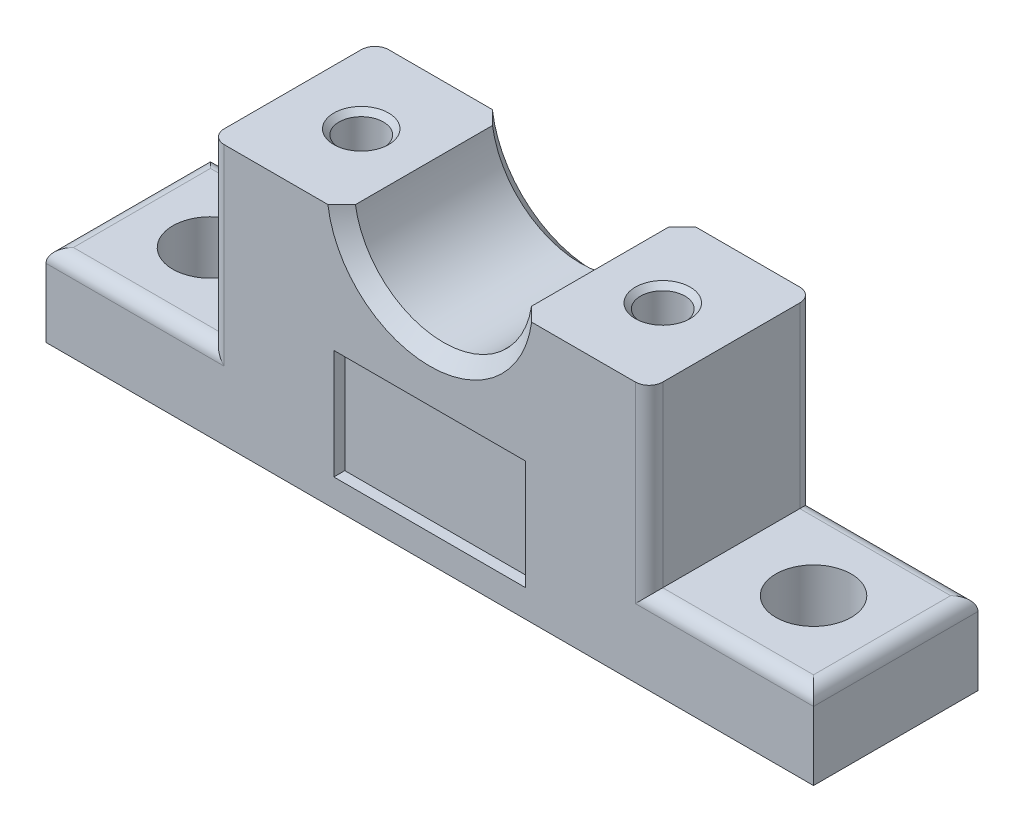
ISO-10303-21;
HEADER;
FILE_DESCRIPTION(('STEP AP214'),'2;1');
FILE_NAME('part.step','',(''),(''),'','','');
FILE_SCHEMA(('AUTOMOTIVE_DESIGN { 1 0 10303 214 1 1 1 1 }'));
ENDSEC;
DATA;
#1=APPLICATION_CONTEXT('core data for automotive mechanical design processes');
#2=APPLICATION_PROTOCOL_DEFINITION('international standard','automotive_design',2000,#1);
#3=PRODUCT_CONTEXT('',#1,'mechanical');
#4=PRODUCT('Part','Part','',(#3));
#5=PRODUCT_RELATED_PRODUCT_CATEGORY('part','',(#4));
#6=PRODUCT_DEFINITION_FORMATION('','',#4);
#7=PRODUCT_DEFINITION_CONTEXT('part definition',#1,'design');
#8=PRODUCT_DEFINITION('design','',#6,#7);
#9=PRODUCT_DEFINITION_SHAPE('','',#8);
#10=(LENGTH_UNIT() NAMED_UNIT(*) SI_UNIT(.MILLI.,.METRE.));
#11=(NAMED_UNIT(*) PLANE_ANGLE_UNIT() SI_UNIT($,.RADIAN.));
#12=(NAMED_UNIT(*) SI_UNIT($,.STERADIAN.) SOLID_ANGLE_UNIT());
#13=UNCERTAINTY_MEASURE_WITH_UNIT(LENGTH_MEASURE(1.E-05),#10,'distance_accuracy_value','');
#14=(GEOMETRIC_REPRESENTATION_CONTEXT(3) GLOBAL_UNCERTAINTY_ASSIGNED_CONTEXT((#13)) GLOBAL_UNIT_ASSIGNED_CONTEXT((#10,
#11,#12)) REPRESENTATION_CONTEXT('',''));
#15=CARTESIAN_POINT('',(0.,0.,0.));
#16=DIRECTION('',(0.,0.,1.));
#17=DIRECTION('',(1.,0.,0.));
#18=AXIS2_PLACEMENT_3D('',#15,#16,#17);
#19=CARTESIAN_POINT('',(-27.0000000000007,5.00000000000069,6.));
#20=DIRECTION('',(0.,0.,1.));
#21=DIRECTION('',(1.,0.,0.));
#22=AXIS2_PLACEMENT_3D('',#19,#20,#21);
#23=PLANE('',#22);
#24=DIRECTION('',(-1.,0.,0.));
#25=VECTOR('',#24,1.);
#26=CARTESIAN_POINT('',(7.,10.,6.));
#27=LINE('',#26,#25);
#28=CARTESIAN_POINT('',(7.,10.,6.));
#29=VERTEX_POINT('',#28);
#30=CARTESIAN_POINT('',(-7.,10.,6.));
#31=VERTEX_POINT('',#30);
#32=EDGE_CURVE('E7',#29,#31,#27,.T.);
#33=ORIENTED_EDGE('',*,*,#32,.F.);
#34=DIRECTION('',(0.,1.,0.));
#35=VECTOR('',#34,1.);
#36=CARTESIAN_POINT('',(7.,2.,6.));
#37=LINE('',#36,#35);
#38=CARTESIAN_POINT('',(7.,2.,6.));
#39=VERTEX_POINT('',#38);
#40=EDGE_CURVE('E14',#39,#29,#37,.T.);
#41=ORIENTED_EDGE('',*,*,#40,.F.);
#42=DIRECTION('',(1.,0.,0.));
#43=VECTOR('',#42,1.);
#44=CARTESIAN_POINT('',(-7.,2.,6.));
#45=LINE('',#44,#43);
#46=CARTESIAN_POINT('',(-7.,2.,6.));
#47=VERTEX_POINT('',#46);
#48=EDGE_CURVE('E21',#47,#39,#45,.T.);
#49=ORIENTED_EDGE('',*,*,#48,.F.);
#50=DIRECTION('',(0.,-1.,0.));
#51=VECTOR('',#50,1.);
#52=CARTESIAN_POINT('',(-7.,10.,6.));
#53=LINE('',#52,#51);
#54=EDGE_CURVE('E28',#31,#47,#53,.T.);
#55=ORIENTED_EDGE('',*,*,#54,.F.);
#56=EDGE_LOOP('',(#33,#41,#49,#55));
#57=FACE_BOUND('',#56,.T.);
#58=DIRECTION('',(0.,-1.,0.));
#59=VECTOR('',#58,1.);
#60=CARTESIAN_POINT('',(15.,19.,6.));
#61=LINE('',#60,#59);
#62=CARTESIAN_POINT('',(15.,19.,6.));
#63=VERTEX_POINT('',#62);
#64=CARTESIAN_POINT('',(15.0000000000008,5.,6.));
#65=VERTEX_POINT('',#64);
#66=EDGE_CURVE('E36',#63,#65,#61,.T.);
#67=ORIENTED_EDGE('',*,*,#66,.F.);
#68=DIRECTION('',(-1.,0.,0.));
#69=VECTOR('',#68,1.);
#70=CARTESIAN_POINT('',(15.,19.,6.));
#71=LINE('',#70,#69);
#72=CARTESIAN_POINT('',(7.43303437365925,19.,6.));
#73=VERTEX_POINT('',#72);
#74=EDGE_CURVE('E43',#63,#73,#71,.T.);
#75=ORIENTED_EDGE('',*,*,#74,.T.);
#76=CARTESIAN_POINT('',(0.,20.,6.));
#77=DIRECTION('',(0.,0.,-1.));
#78=DIRECTION('',(0.991071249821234,-0.133333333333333,0.));
#79=AXIS2_PLACEMENT_3D('',#76,#77,#78);
#80=CIRCLE('',#79,7.5);
#81=CARTESIAN_POINT('',(-7.43303437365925,19.,6.));
#82=VERTEX_POINT('',#81);
#83=EDGE_CURVE('E50',#73,#82,#80,.T.);
#84=ORIENTED_EDGE('',*,*,#83,.T.);
#85=DIRECTION('',(-1.,0.,0.));
#86=VECTOR('',#85,1.);
#87=CARTESIAN_POINT('',(-7.43303437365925,19.,6.));
#88=LINE('',#87,#86);
#89=CARTESIAN_POINT('',(-15.,19.,6.));
#90=VERTEX_POINT('',#89);
#91=EDGE_CURVE('E57',#82,#90,#88,.T.);
#92=ORIENTED_EDGE('',*,*,#91,.T.);
#93=DIRECTION('',(0.,-1.,0.));
#94=VECTOR('',#93,1.);
#95=CARTESIAN_POINT('',(-15.,19.,6.));
#96=LINE('',#95,#94);
#97=CARTESIAN_POINT('',(-15.,5.,6.));
#98=VERTEX_POINT('',#97);
#99=EDGE_CURVE('E64',#90,#98,#96,.T.);
#100=ORIENTED_EDGE('',*,*,#99,.T.);
#101=DIRECTION('',(-1.,0.,0.));
#102=VECTOR('',#101,1.);
#103=CARTESIAN_POINT('',(-15.,5.,6.));
#104=LINE('',#103,#102);
#105=CARTESIAN_POINT('',(-28.,5.,6.));
#106=VERTEX_POINT('',#105);
#107=EDGE_CURVE('E71',#98,#106,#104,.T.);
#108=ORIENTED_EDGE('',*,*,#107,.T.);
#109=DIRECTION('',(0.,-1.,0.));
#110=VECTOR('',#109,1.);
#111=CARTESIAN_POINT('',(-28.,5.,6.));
#112=LINE('',#111,#110);
#113=CARTESIAN_POINT('',(-28.,0.,6.));
#114=VERTEX_POINT('',#113);
#115=EDGE_CURVE('E78',#106,#114,#112,.T.);
#116=ORIENTED_EDGE('',*,*,#115,.T.);
#117=DIRECTION('',(1.,0.,0.));
#118=VECTOR('',#117,1.);
#119=CARTESIAN_POINT('',(-28.,0.,6.));
#120=LINE('',#119,#118);
#121=CARTESIAN_POINT('',(28.,0.,6.));
#122=VERTEX_POINT('',#121);
#123=EDGE_CURVE('E85',#114,#122,#120,.T.);
#124=ORIENTED_EDGE('',*,*,#123,.T.);
#125=DIRECTION('',(0.,1.,0.));
#126=VECTOR('',#125,1.);
#127=CARTESIAN_POINT('',(28.,0.,6.));
#128=LINE('',#127,#126);
#129=CARTESIAN_POINT('',(28.,5.,6.));
#130=VERTEX_POINT('',#129);
#131=EDGE_CURVE('E92',#122,#130,#128,.T.);
#132=ORIENTED_EDGE('',*,*,#131,.T.);
#133=DIRECTION('',(-1.,0.,0.));
#134=VECTOR('',#133,1.);
#135=CARTESIAN_POINT('',(28.,5.,6.));
#136=LINE('',#135,#134);
#137=EDGE_CURVE('E99',#130,#65,#136,.T.);
#138=ORIENTED_EDGE('',*,*,#137,.T.);
#139=EDGE_LOOP('',(#67,#75,#84,#92,#100,#108,#116,#124,#132,#138));
#140=FACE_BOUND('',#139,.T.);
#141=ADVANCED_FACE('F105',(#57,#140),#23,.T.);
#142=CARTESIAN_POINT('',(7.,10.,5.2));
#143=DIRECTION('',(0.,1.,0.));
#144=DIRECTION('',(0.,0.,1.));
#145=AXIS2_PLACEMENT_3D('',#142,#143,#144);
#146=PLANE('',#145);
#147=ORIENTED_EDGE('',*,*,#32,.T.);
#148=DIRECTION('',(0.,0.,1.));
#149=VECTOR('',#148,1.);
#150=CARTESIAN_POINT('',(-7.,10.,5.2));
#151=LINE('',#150,#149);
#152=CARTESIAN_POINT('',(-7.,10.,5.2));
#153=VERTEX_POINT('',#152);
#154=EDGE_CURVE('E119',#153,#31,#151,.T.);
#155=ORIENTED_EDGE('',*,*,#154,.F.);
#156=DIRECTION('',(-1.,0.,0.));
#157=VECTOR('',#156,1.);
#158=CARTESIAN_POINT('',(7.,10.,5.2));
#159=LINE('',#158,#157);
#160=CARTESIAN_POINT('',(7.,10.,5.2));
#161=VERTEX_POINT('',#160);
#162=EDGE_CURVE('E126',#161,#153,#159,.T.);
#163=ORIENTED_EDGE('',*,*,#162,.F.);
#164=DIRECTION('',(0.,0.,1.));
#165=VECTOR('',#164,1.);
#166=CARTESIAN_POINT('',(7.,10.,5.2));
#167=LINE('',#166,#165);
#168=EDGE_CURVE('E133',#161,#29,#167,.T.);
#169=ORIENTED_EDGE('',*,*,#168,.T.);
#170=EDGE_LOOP('',(#147,#155,#163,#169));
#171=FACE_BOUND('',#170,.T.);
#172=ADVANCED_FACE('F137',(#171),#146,.F.);
#173=CARTESIAN_POINT('',(7.,2.,5.2));
#174=DIRECTION('',(1.,0.,0.));
#175=DIRECTION('',(0.,0.,-1.));
#176=AXIS2_PLACEMENT_3D('',#173,#174,#175);
#177=PLANE('',#176);
#178=ORIENTED_EDGE('',*,*,#40,.T.);
#179=ORIENTED_EDGE('',*,*,#168,.F.);
#180=DIRECTION('',(0.,1.,0.));
#181=VECTOR('',#180,1.);
#182=CARTESIAN_POINT('',(7.,2.,5.2));
#183=LINE('',#182,#181);
#184=CARTESIAN_POINT('',(7.,2.,5.2));
#185=VERTEX_POINT('',#184);
#186=EDGE_CURVE('E148',#185,#161,#183,.T.);
#187=ORIENTED_EDGE('',*,*,#186,.F.);
#188=DIRECTION('',(0.,0.,1.));
#189=VECTOR('',#188,1.);
#190=CARTESIAN_POINT('',(7.,2.,5.2));
#191=LINE('',#190,#189);
#192=EDGE_CURVE('E155',#185,#39,#191,.T.);
#193=ORIENTED_EDGE('',*,*,#192,.T.);
#194=EDGE_LOOP('',(#178,#179,#187,#193));
#195=FACE_BOUND('',#194,.T.);
#196=ADVANCED_FACE('F159',(#195),#177,.F.);
#197=CARTESIAN_POINT('',(-7.,2.,5.2));
#198=DIRECTION('',(0.,-1.,0.));
#199=DIRECTION('',(0.,0.,-1.));
#200=AXIS2_PLACEMENT_3D('',#197,#198,#199);
#201=PLANE('',#200);
#202=ORIENTED_EDGE('',*,*,#48,.T.);
#203=ORIENTED_EDGE('',*,*,#192,.F.);
#204=DIRECTION('',(1.,0.,0.));
#205=VECTOR('',#204,1.);
#206=CARTESIAN_POINT('',(-7.,2.,5.2));
#207=LINE('',#206,#205);
#208=CARTESIAN_POINT('',(-7.,2.,5.2));
#209=VERTEX_POINT('',#208);
#210=EDGE_CURVE('E170',#209,#185,#207,.T.);
#211=ORIENTED_EDGE('',*,*,#210,.F.);
#212=DIRECTION('',(0.,0.,1.));
#213=VECTOR('',#212,1.);
#214=CARTESIAN_POINT('',(-7.,2.,5.2));
#215=LINE('',#214,#213);
#216=EDGE_CURVE('E177',#209,#47,#215,.T.);
#217=ORIENTED_EDGE('',*,*,#216,.T.);
#218=EDGE_LOOP('',(#202,#203,#211,#217));
#219=FACE_BOUND('',#218,.T.);
#220=ADVANCED_FACE('F181',(#219),#201,.F.);
#221=CARTESIAN_POINT('',(-7.,10.,5.2));
#222=DIRECTION('',(-1.,0.,0.));
#223=DIRECTION('',(0.,0.,1.));
#224=AXIS2_PLACEMENT_3D('',#221,#222,#223);
#225=PLANE('',#224);
#226=ORIENTED_EDGE('',*,*,#54,.T.);
#227=ORIENTED_EDGE('',*,*,#216,.F.);
#228=DIRECTION('',(0.,-1.,0.));
#229=VECTOR('',#228,1.);
#230=CARTESIAN_POINT('',(-7.,10.,5.2));
#231=LINE('',#230,#229);
#232=EDGE_CURVE('E192',#153,#209,#231,.T.);
#233=ORIENTED_EDGE('',*,*,#232,.F.);
#234=ORIENTED_EDGE('',*,*,#154,.T.);
#235=EDGE_LOOP('',(#226,#227,#233,#234));
#236=FACE_BOUND('',#235,.T.);
#237=ADVANCED_FACE('F197',(#236),#225,.F.);
#238=CARTESIAN_POINT('',(15.0000000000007,20.,5.00000000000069));
#239=DIRECTION('',(0.,-1.,0.));
#240=DIRECTION('',(0.,0.,-1.));
#241=AXIS2_PLACEMENT_3D('',#238,#239,#240);
#242=CYLINDRICAL_SURFACE('',#241,0.999999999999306);
#243=CARTESIAN_POINT('',(15.0000000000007,19.,5.00000000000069));
#244=DIRECTION('',(0.,1.,0.));
#245=DIRECTION('',(0.,0.,1.));
#246=AXIS2_PLACEMENT_3D('',#243,#244,#245);
#247=CIRCLE('',#246,0.999999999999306);
#248=CARTESIAN_POINT('',(16.,19.,5.));
#249=VERTEX_POINT('',#248);
#250=EDGE_CURVE('E206',#63,#249,#247,.T.);
#251=ORIENTED_EDGE('',*,*,#250,.F.);
#252=ORIENTED_EDGE('',*,*,#66,.T.);
#253=CARTESIAN_POINT('',(15.0000000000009,5.,6.));
#254=CARTESIAN_POINT('',(15.0215379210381,5.02153854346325,5.99999912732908));
#255=CARTESIAN_POINT('',(15.0430802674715,5.04307339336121,5.9993041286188));
#256=CARTESIAN_POINT('',(15.0862924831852,5.08626214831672,5.99650716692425));
#257=CARTESIAN_POINT('',(15.107962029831,5.10791566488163,5.99439422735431));
#258=CARTESIAN_POINT('',(15.1512580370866,5.15117911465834,5.98873586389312));
#259=CARTESIAN_POINT('',(15.1728842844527,5.1727888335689,5.98518716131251));
#260=CARTESIAN_POINT('',(15.2159215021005,5.21580173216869,5.97665637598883));
#261=CARTESIAN_POINT('',(15.2373329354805,5.23720534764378,5.97167883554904));
#262=CARTESIAN_POINT('',(15.2797712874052,5.27964263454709,5.96031579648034));
#263=CARTESIAN_POINT('',(15.3007999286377,5.3006779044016,5.95394272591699));
#264=CARTESIAN_POINT('',(15.3423100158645,5.34221432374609,5.93983912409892));
#265=CARTESIAN_POINT('',(15.3627949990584,5.36271882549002,5.93212891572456));
#266=CARTESIAN_POINT('',(15.4030644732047,5.40302986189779,5.91542607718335));
#267=CARTESIAN_POINT('',(15.4228548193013,5.42284219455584,5.90646162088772));
#268=CARTESIAN_POINT('',(15.4616810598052,5.46168485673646,5.88730438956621));
#269=CARTESIAN_POINT('',(15.4807240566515,5.48072286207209,5.8771416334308));
#270=CARTESIAN_POINT('',(15.5181693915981,5.51815002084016,5.8555475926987));
#271=CARTESIAN_POINT('',(15.5365768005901,5.53654435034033,5.8441341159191));
#272=CARTESIAN_POINT('',(15.5726698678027,5.57261167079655,5.82006897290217));
#273=CARTESIAN_POINT('',(15.5903620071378,5.59029113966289,5.80743676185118));
#274=CARTESIAN_POINT('',(15.6249330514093,5.62484408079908,5.78097692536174));
#275=CARTESIAN_POINT('',(15.641820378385,5.64172586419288,5.7671712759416));
#276=CARTESIAN_POINT('',(15.6665810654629,5.66648570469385,5.74551180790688));
#277=CARTESIAN_POINT('',(15.6746883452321,5.67459391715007,5.73818446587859));
#278=CARTESIAN_POINT('',(15.6906675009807,5.69057732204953,5.72325435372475));
#279=CARTESIAN_POINT('',(15.6985408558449,5.69845397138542,5.71565473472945));
#280=CARTESIAN_POINT('',(15.7140414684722,5.71396320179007,5.70018819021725));
#281=CARTESIAN_POINT('',(15.7216703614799,5.72159739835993,5.6923245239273));
#282=CARTESIAN_POINT('',(15.7366720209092,5.7366111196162,5.67633814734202));
#283=CARTESIAN_POINT('',(15.7440465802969,5.74399242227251,5.66821879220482));
#284=CARTESIAN_POINT('',(15.7585298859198,5.75848933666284,5.65172968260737));
#285=CARTESIAN_POINT('',(15.7656405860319,5.76560690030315,5.64336336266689));
#286=CARTESIAN_POINT('',(15.7795864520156,5.77956647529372,5.6263899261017));
#287=CARTESIAN_POINT('',(15.7864237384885,5.78641060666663,5.6177862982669));
#288=CARTESIAN_POINT('',(15.7998149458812,5.79980925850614,5.60034622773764));
#289=CARTESIAN_POINT('',(15.8063711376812,5.80636611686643,5.59151332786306));
#290=CARTESIAN_POINT('',(15.8191680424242,5.81917242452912,5.57365721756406));
#291=CARTESIAN_POINT('',(15.8254118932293,5.8254248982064,5.56463842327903));
#292=CARTESIAN_POINT('',(15.8375358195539,5.83761991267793,5.54648935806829));
#293=CARTESIAN_POINT('',(15.8434206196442,5.84356612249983,5.53736471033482));
#294=CARTESIAN_POINT('',(15.8548408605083,5.85513419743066,5.51900075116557));
#295=CARTESIAN_POINT('',(15.8603807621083,5.86076003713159,5.50976672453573));
#296=CARTESIAN_POINT('',(15.8711208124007,5.87168750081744,5.49118398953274));
#297=CARTESIAN_POINT('',(15.8763251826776,5.87699305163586,5.48184003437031));
#298=CARTESIAN_POINT('',(15.8864034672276,5.88727667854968,5.46303442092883));
#299=CARTESIAN_POINT('',(15.8912813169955,5.89225861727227,5.4535769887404));
#300=CARTESIAN_POINT('',(15.9007139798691,5.90189274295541,5.43454061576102));
#301=CARTESIAN_POINT('',(15.9052724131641,5.90654862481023,5.42496534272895));
#302=CARTESIAN_POINT('',(15.9140721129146,5.91552821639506,5.40568832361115));
#303=CARTESIAN_POINT('',(15.9183166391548,5.9198553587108,5.39598966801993));
#304=CARTESIAN_POINT('',(15.9264926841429,5.92817521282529,5.37646005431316));
#305=CARTESIAN_POINT('',(15.9304270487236,5.93217098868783,5.36663159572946));
#306=CARTESIAN_POINT('',(15.9379851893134,5.93982594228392,5.34683579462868));
#307=CARTESIAN_POINT('',(15.9416113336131,5.94348770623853,5.3368703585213));
#308=CARTESIAN_POINT('',(15.9485536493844,5.95047258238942,5.31679342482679));
#309=CARTESIAN_POINT('',(15.9518716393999,5.95379769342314,5.30668325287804));
#310=CARTESIAN_POINT('',(15.95819640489,5.96010731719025,5.28630921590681));
#311=CARTESIAN_POINT('',(15.9612043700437,5.96309313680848,5.2760461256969));
#312=CARTESIAN_POINT('',(15.9669059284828,5.96872233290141,5.25535831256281));
#313=CARTESIAN_POINT('',(15.969599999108,5.97136623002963,5.24493386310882));
#314=CARTESIAN_POINT('',(15.9746686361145,5.97630982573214,5.22391523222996));
#315=CARTESIAN_POINT('',(15.9770428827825,5.97860918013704,5.21332089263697));
#316=CARTESIAN_POINT('',(15.9814647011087,5.9828620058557,5.19195437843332));
#317=CARTESIAN_POINT('',(15.9835110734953,5.98481421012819,5.18118170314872));
#318=CARTESIAN_POINT('',(15.987267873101,5.98837110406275,5.15945057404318));
#319=CARTESIAN_POINT('',(15.9889761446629,5.9899735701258,5.14849138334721));
#320=CARTESIAN_POINT('',(15.9920452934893,5.99282936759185,5.12637962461));
#321=CARTESIAN_POINT('',(15.9934029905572,5.99407951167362,5.11522620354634));
#322=CARTESIAN_POINT('',(15.9957573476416,5.99622909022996,5.09271889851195));
#323=CARTESIAN_POINT('',(15.9967497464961,5.99712439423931,5.08136417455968));
#324=CARTESIAN_POINT('',(15.998357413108,5.99856250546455,5.05844800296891));
#325=CARTESIAN_POINT('',(15.9989672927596,5.99910028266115,5.04688586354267));
#326=CARTESIAN_POINT('',(15.9997920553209,5.99982219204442,5.02354928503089));
#327=CARTESIAN_POINT('',(16.0000004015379,6.00000047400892,5.01177443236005));
#328=CARTESIAN_POINT('',(16.,5.99999999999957,5.00000000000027));
#329=B_SPLINE_CURVE_WITH_KNOTS('',3,(#253,#254,#255,#256,#257,#258,#259,#260,#261,#262,#263,
#264,#265,#266,#267,#268,#269,#270,#271,#272,#273,#274,#275,#276,#277,#278,#279,#280,#281,#282,
#283,#284,#285,#286,#287,#288,#289,#290,#291,#292,#293,#294,#295,#296,#297,#298,#299,#300,#301,
#302,#303,#304,#305,#306,#307,#308,#309,#310,#311,#312,#313,#314,#315,#316,#317,#318,#319,#320,
#321,#322,#323,#324,#325,#326,#327,#328),.UNSPECIFIED.,.F.,.F.,(4,2,2,2,2,2,2,2,2,2,2,2,2,2,2,2,
2,2,2,2,2,2,2,2,2,2,2,2,2,2,2,2,2,2,2,2,2,4),(0.,0.0913719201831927,0.183459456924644,
0.275758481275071,0.367767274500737,0.458987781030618,0.548927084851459,0.637099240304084,
0.723404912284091,0.808611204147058,0.892630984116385,0.975326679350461,1.01614373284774,
1.05658556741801,1.09663987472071,1.13629572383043,1.17554368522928,1.21437596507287,
1.25278655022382,1.2906575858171,1.32778850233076,1.36422916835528,1.40003894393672,
1.43528000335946,1.47001745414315,1.50431941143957,1.5382570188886,1.5719044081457,
1.60533859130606,1.6386392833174,1.67188865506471,1.705171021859,1.73857247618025,
1.7721804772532,1.80608341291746,1.84037015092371,1.87512959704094,1.91045027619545),.UNSPECIFIED.);
#330=CARTESIAN_POINT('',(16.,6.,5.));
#331=VERTEX_POINT('',#330);
#332=EDGE_CURVE('E209',#65,#331,#329,.T.);
#333=ORIENTED_EDGE('',*,*,#332,.T.);
#334=DIRECTION('',(0.,-1.,0.));
#335=VECTOR('',#334,1.);
#336=CARTESIAN_POINT('',(16.,19.,5.));
#337=LINE('',#336,#335);
#338=EDGE_CURVE('E227',#249,#331,#337,.T.);
#339=ORIENTED_EDGE('',*,*,#338,.F.);
#340=EDGE_LOOP('',(#251,#252,#333,#339));
#341=FACE_BOUND('',#340,.T.);
#342=ADVANCED_FACE('F232',(#341),#242,.T.);
#343=CARTESIAN_POINT('',(-28.,19.,12.));
#344=DIRECTION('',(0.,1.,0.));
#345=DIRECTION('',(0.,0.,1.));
#346=AXIS2_PLACEMENT_3D('',#343,#344,#345);
#347=PLANE('',#346);
#348=CARTESIAN_POINT('',(11.,19.,0.));
#349=DIRECTION('',(0.,-1.,0.));
#350=DIRECTION('',(0.,0.,-1.));
#351=AXIS2_PLACEMENT_3D('',#348,#349,#350);
#352=CIRCLE('',#351,2.);
#353=CARTESIAN_POINT('',(11.,19.,-2.));
#354=VERTEX_POINT('',#353);
#355=EDGE_CURVE('E239',#354,#354,#352,.T.);
#356=ORIENTED_EDGE('',*,*,#355,.T.);
#357=EDGE_LOOP('',(#356));
#358=FACE_BOUND('',#357,.T.);
#359=DIRECTION('',(0.,0.,-1.));
#360=VECTOR('',#359,1.);
#361=CARTESIAN_POINT('',(16.,19.,5.));
#362=LINE('',#361,#360);
#363=CARTESIAN_POINT('',(16.,19.,-5.));
#364=VERTEX_POINT('',#363);
#365=EDGE_CURVE('E245',#249,#364,#362,.T.);
#366=ORIENTED_EDGE('',*,*,#365,.T.);
#367=CARTESIAN_POINT('',(15.0000000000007,19.,-5.00000000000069));
#368=DIRECTION('',(0.,1.,0.));
#369=DIRECTION('',(1.,0.,6.89226453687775E-13));
#370=AXIS2_PLACEMENT_3D('',#367,#368,#369);
#371=CIRCLE('',#370,0.999999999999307);
#372=CARTESIAN_POINT('',(15.,19.,-6.));
#373=VERTEX_POINT('',#372);
#374=EDGE_CURVE('E252',#364,#373,#371,.T.);
#375=ORIENTED_EDGE('',*,*,#374,.T.);
#376=DIRECTION('',(-1.,0.,0.));
#377=VECTOR('',#376,1.);
#378=CARTESIAN_POINT('',(15.,19.,-6.));
#379=LINE('',#378,#377);
#380=CARTESIAN_POINT('',(7.43303437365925,19.,-6.));
#381=VERTEX_POINT('',#380);
#382=EDGE_CURVE('E259',#373,#381,#379,.T.);
#383=ORIENTED_EDGE('',*,*,#382,.T.);
#384=CARTESIAN_POINT('',(6.42261212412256,19.,-4.99999588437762));
#385=CARTESIAN_POINT('',(6.43665071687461,19.0000000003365,-5.01386734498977));
#386=CARTESIAN_POINT('',(6.4506887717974,19.0000000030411,-5.02773934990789));
#387=CARTESIAN_POINT('',(6.47876811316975,19.0000000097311,-5.05548866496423));
#388=CARTESIAN_POINT('',(6.49280939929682,19.0000000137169,-5.06936597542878));
#389=CARTESIAN_POINT('',(6.52089387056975,19.00000001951,-5.09712454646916));
#390=CARTESIAN_POINT('',(6.53493705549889,19.0000000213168,-5.11100580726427));
#391=CARTESIAN_POINT('',(6.56302399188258,19.0000000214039,-5.13877092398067));
#392=CARTESIAN_POINT('',(6.57706774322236,19.0000000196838,-5.15265478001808));
#393=CARTESIAN_POINT('',(6.6051544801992,19.0000000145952,-5.18042373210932));
#394=CARTESIAN_POINT('',(6.61919746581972,19.0000000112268,-5.19430882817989));
#395=CARTESIAN_POINT('',(6.64728133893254,19.0000000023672,-5.22207890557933));
#396=CARTESIAN_POINT('',(6.66132222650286,18.9999999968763,-5.2359638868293));
#397=CARTESIAN_POINT('',(6.68940209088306,19.0000000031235,-5.26373388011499));
#398=CARTESIAN_POINT('',(6.70344106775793,19.0000000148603,-5.277618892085));
#399=CARTESIAN_POINT('',(6.73151805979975,19.0000000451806,-5.30538985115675));
#400=CARTESIAN_POINT('',(6.74555607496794,19.000000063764,-5.31927579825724));
#401=CARTESIAN_POINT('',(6.77363095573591,19.0000000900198,-5.34704840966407));
#402=CARTESIAN_POINT('',(6.78766782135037,19.0000000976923,-5.36093507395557));
#403=CARTESIAN_POINT('',(6.81574021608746,19.0000000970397,-5.38870890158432));
#404=CARTESIAN_POINT('',(6.82977574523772,19.000000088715,-5.40259606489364));
#405=CARTESIAN_POINT('',(6.85784528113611,19.0000000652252,-5.43037067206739));
#406=CARTESIAN_POINT('',(6.87187928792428,19.0000000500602,-5.44425811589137));
#407=CARTESIAN_POINT('',(6.89994559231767,19.0000000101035,-5.47203306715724));
#408=CARTESIAN_POINT('',(6.9139778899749,18.9999999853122,-5.48592057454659));
#409=CARTESIAN_POINT('',(6.94204069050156,19.0000000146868,-5.51369552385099));
#410=CARTESIAN_POINT('',(6.95607119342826,19.0000000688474,-5.52758296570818));
#411=CARTESIAN_POINT('',(6.98413067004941,19.0000002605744,-5.55535801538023));
#412=CARTESIAN_POINT('',(6.99815964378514,19.0000003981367,-5.5692456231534));
#413=CARTESIAN_POINT('',(7.02621640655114,19.0000006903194,-5.59702132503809));
#414=CARTESIAN_POINT('',(7.04024419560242,19.0000008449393,-5.61090941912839));
#415=CARTESIAN_POINT('',(7.06829893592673,19.0000011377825,-5.63868641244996));
#416=CARTESIAN_POINT('',(7.08232588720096,19.0000012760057,-5.65257531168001));
#417=CARTESIAN_POINT('',(7.11037929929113,19.0000015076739,-5.68035423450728));
#418=CARTESIAN_POINT('',(7.12440576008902,19.0000016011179,-5.69424425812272));
#419=CARTESIAN_POINT('',(7.15245853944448,19.0000017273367,-5.72202574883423));
#420=CARTESIAN_POINT('',(7.16648485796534,19.0000017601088,-5.73591721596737));
#421=CARTESIAN_POINT('',(7.19453770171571,19.0000017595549,-5.76370191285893));
#422=CARTESIAN_POINT('',(7.20856422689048,19.0000017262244,-5.77759514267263));
#423=CARTESIAN_POINT('',(7.2366178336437,19.0000015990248,-5.80538368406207));
#424=CARTESIAN_POINT('',(7.25064491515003,19.0000015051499,-5.81927899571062));
#425=CARTESIAN_POINT('',(7.27869998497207,19.0000012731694,-5.84707201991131));
#426=CARTESIAN_POINT('',(7.29272797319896,19.0000011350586,-5.86096973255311));
#427=CARTESIAN_POINT('',(7.32078520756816,19.0000008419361,-5.88876787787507));
#428=CARTESIAN_POINT('',(7.33481445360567,19.000000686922,-5.90266831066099));
#429=CARTESIAN_POINT('',(7.36287455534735,19.000000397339,-5.93047221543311));
#430=CARTESIAN_POINT('',(7.37690541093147,19.0000002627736,-5.94437568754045));
#431=CARTESIAN_POINT('',(7.40496908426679,19.0000000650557,-5.97218599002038));
#432=CARTESIAN_POINT('',(7.4190019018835,19.0000000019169,-5.98609282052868));
#433=CARTESIAN_POINT('',(7.43303437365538,19.,-5.99999999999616));
#434=B_SPLINE_CURVE_WITH_KNOTS('',3,(#384,#385,#386,#387,#388,#389,#390,#391,#392,#393,#394,
#395,#396,#397,#398,#399,#400,#401,#402,#403,#404,#405,#406,#407,#408,#409,#410,#411,#412,#413,
#414,#415,#416,#417,#418,#419,#420,#421,#422,#423,#424,#425,#426,#427,#428,#429,#430,#431,#432,
#433),.UNSPECIFIED.,.F.,.F.,(4,2,2,2,2,2,2,2,2,2,2,2,2,2,2,2,2,2,2,2,2,2,2,2,4),(0.,
0.0592072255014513,0.118432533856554,0.177670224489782,0.236914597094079,0.29615995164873,
0.355400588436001,0.414637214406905,0.473873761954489,0.533109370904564,0.592343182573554,
0.651574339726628,0.710801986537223,0.770025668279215,0.829246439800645,0.888465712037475,
0.947684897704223,1.00690541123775,1.06612866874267,1.12535608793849,1.18458908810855,
1.24382909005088,1.30307751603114,1.36233578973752,1.42160533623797),.UNSPECIFIED.);
#435=CARTESIAN_POINT('',(6.42261628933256,19.,-5.));
#436=VERTEX_POINT('',#435);
#437=EDGE_CURVE('E263',#436,#381,#434,.T.);
#438=ORIENTED_EDGE('',*,*,#437,.F.);
#439=DIRECTION('',(0.,0.,-1.));
#440=VECTOR('',#439,1.);
#441=CARTESIAN_POINT('',(6.42261628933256,19.,5.));
#442=LINE('',#441,#440);
#443=CARTESIAN_POINT('',(6.42261628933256,19.,5.));
#444=VERTEX_POINT('',#443);
#445=EDGE_CURVE('E281',#444,#436,#442,.T.);
#446=ORIENTED_EDGE('',*,*,#445,.F.);
#447=CARTESIAN_POINT('',(7.43303437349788,19.,5.99999999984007));
#448=CARTESIAN_POINT('',(7.41198442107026,19.0000000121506,5.97913799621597));
#449=CARTESIAN_POINT('',(7.39093369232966,19.0000001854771,5.9582767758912));
#450=CARTESIAN_POINT('',(7.34884059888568,19.0000006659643,5.91656583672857));
#451=CARTESIAN_POINT('',(7.32779823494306,19.0000009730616,5.89571611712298));
#452=CARTESIAN_POINT('',(7.28571913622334,19.0000015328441,5.85402557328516));
#453=CARTESIAN_POINT('',(7.26468240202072,19.0000017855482,5.83318474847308));
#454=CARTESIAN_POINT('',(7.22261183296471,19.0000021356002,5.79150938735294));
#455=CARTESIAN_POINT('',(7.20157799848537,19.0000022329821,5.77067485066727));
#456=CARTESIAN_POINT('',(7.15951050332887,19.0000022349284,5.72900945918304));
#457=CARTESIAN_POINT('',(7.1384768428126,19.0000021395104,5.70817860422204));
#458=CARTESIAN_POINT('',(7.09640697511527,19.0000017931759,5.66651796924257));
#459=CARTESIAN_POINT('',(7.07537076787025,19.0000015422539,5.64568818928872));
#460=CARTESIAN_POINT('',(7.0332930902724,19.0000009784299,5.60402709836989));
#461=CARTESIAN_POINT('',(7.01225161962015,19.0000006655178,5.58319578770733));
#462=CARTESIAN_POINT('',(6.97016070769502,19.0000001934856,5.5415290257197));
#463=CARTESIAN_POINT('',(6.94911126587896,19.00000003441,5.52069357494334));
#464=CARTESIAN_POINT('',(6.90700328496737,18.9999999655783,5.47901750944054));
#465=CARTESIAN_POINT('',(6.88594474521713,19.0000000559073,5.45817689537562));
#466=CARTESIAN_POINT('',(6.84382122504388,19.0000002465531,5.41649327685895));
#467=CARTESIAN_POINT('',(6.82275624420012,19.0000003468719,5.39565027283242));
#468=CARTESIAN_POINT('',(6.78062282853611,19.0000005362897,5.35396494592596));
#469=CARTESIAN_POINT('',(6.75955439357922,19.000000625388,5.33312262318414));
#470=CARTESIAN_POINT('',(6.71741705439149,19.0000007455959,5.29144173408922));
#471=CARTESIAN_POINT('',(6.69634815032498,19.0000007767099,5.27060316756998));
#472=CARTESIAN_POINT('',(6.6542128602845,19.0000007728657,5.22893286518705));
#473=CARTESIAN_POINT('',(6.63314647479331,19.0000007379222,5.20810112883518));
#474=CARTESIAN_POINT('',(6.59101921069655,19.0000006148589,5.16644756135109));
#475=CARTESIAN_POINT('',(6.56995833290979,19.0000005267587,5.14562572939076));
#476=CARTESIAN_POINT('',(6.52784507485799,19.0000003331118,5.10399504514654));
#477=CARTESIAN_POINT('',(6.50679269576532,19.000000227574,5.08318619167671));
#478=CARTESIAN_POINT('',(6.4646994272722,19.0000000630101,5.04158453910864));
#479=CARTESIAN_POINT('',(6.44365853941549,19.0000000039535,5.02079173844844));
#480=CARTESIAN_POINT('',(6.42261644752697,19.,5.00000015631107));
#481=B_SPLINE_CURVE_WITH_KNOTS('',3,(#447,#448,#449,#450,#451,#452,#453,#454,#455,#456,#457,
#458,#459,#460,#461,#462,#463,#464,#465,#466,#467,#468,#469,#470,#471,#472,#473,#474,#475,#476,
#477,#478,#479,#480),.UNSPECIFIED.,.F.,.F.,(4,2,2,2,2,2,2,2,2,2,2,2,2,2,2,2,4),(0.,
0.0889095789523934,0.177777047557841,0.266613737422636,0.355430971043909,0.444240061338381,
0.533052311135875,0.621879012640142,0.710731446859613,0.799614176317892,0.888515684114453,
0.977423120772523,1.06632363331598,1.15520436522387,1.24405245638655,1.33285504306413,
1.42159925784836),.UNSPECIFIED.);
#482=EDGE_CURVE('E285',#73,#444,#481,.T.);
#483=ORIENTED_EDGE('',*,*,#482,.F.);
#484=ORIENTED_EDGE('',*,*,#74,.F.);
#485=ORIENTED_EDGE('',*,*,#250,.T.);
#486=EDGE_LOOP('',(#366,#375,#383,#438,#446,#483,#484,#485));
#487=FACE_BOUND('',#486,.T.);
#488=ADVANCED_FACE('F300',(#358,#487),#347,.T.);
#489=CARTESIAN_POINT('',(0.,20.,6.));
#490=DIRECTION('',(0.,0.,1.));
#491=DIRECTION('',(1.,0.,0.));
#492=AXIS2_PLACEMENT_3D('',#489,#490,#491);
#493=CONICAL_SURFACE('',#492,7.5,0.785398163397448);
#494=ORIENTED_EDGE('',*,*,#83,.F.);
#495=ORIENTED_EDGE('',*,*,#482,.T.);
#496=CARTESIAN_POINT('',(0.,20.,5.));
#497=DIRECTION('',(0.,0.,-1.));
#498=DIRECTION('',(0.988094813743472,-0.153846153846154,0.));
#499=AXIS2_PLACEMENT_3D('',#496,#497,#498);
#500=CIRCLE('',#499,6.5);
#501=CARTESIAN_POINT('',(-6.42261628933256,19.,5.));
#502=VERTEX_POINT('',#501);
#503=EDGE_CURVE('E322',#444,#502,#500,.T.);
#504=ORIENTED_EDGE('',*,*,#503,.T.);
#505=CARTESIAN_POINT('',(-6.42261212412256,19.,4.99999588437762));
#506=CARTESIAN_POINT('',(-6.43665071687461,19.0000000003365,5.01386734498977));
#507=CARTESIAN_POINT('',(-6.4506887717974,19.0000000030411,5.02773934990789));
#508=CARTESIAN_POINT('',(-6.47876811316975,19.0000000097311,5.05548866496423));
#509=CARTESIAN_POINT('',(-6.49280939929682,19.0000000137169,5.06936597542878));
#510=CARTESIAN_POINT('',(-6.52089387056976,19.00000001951,5.09712454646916));
#511=CARTESIAN_POINT('',(-6.53493705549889,19.0000000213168,5.11100580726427));
#512=CARTESIAN_POINT('',(-6.56302399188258,19.0000000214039,5.13877092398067));
#513=CARTESIAN_POINT('',(-6.57706774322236,19.0000000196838,5.15265478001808));
#514=CARTESIAN_POINT('',(-6.60515448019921,19.0000000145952,5.18042373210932));
#515=CARTESIAN_POINT('',(-6.61919746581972,19.0000000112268,5.19430882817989));
#516=CARTESIAN_POINT('',(-6.64728133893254,19.0000000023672,5.22207890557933));
#517=CARTESIAN_POINT('',(-6.66132222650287,18.9999999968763,5.2359638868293));
#518=CARTESIAN_POINT('',(-6.68940209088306,19.0000000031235,5.26373388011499));
#519=CARTESIAN_POINT('',(-6.70344106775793,19.0000000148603,5.277618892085));
#520=CARTESIAN_POINT('',(-6.73151805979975,19.0000000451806,5.30538985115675));
#521=CARTESIAN_POINT('',(-6.74555607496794,19.000000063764,5.31927579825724));
#522=CARTESIAN_POINT('',(-6.77363095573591,19.0000000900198,5.34704840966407));
#523=CARTESIAN_POINT('',(-6.78766782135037,19.0000000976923,5.36093507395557));
#524=CARTESIAN_POINT('',(-6.81574021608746,19.0000000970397,5.38870890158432));
#525=CARTESIAN_POINT('',(-6.82977574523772,19.000000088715,5.40259606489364));
#526=CARTESIAN_POINT('',(-6.85784528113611,19.0000000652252,5.43037067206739));
#527=CARTESIAN_POINT('',(-6.87187928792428,19.0000000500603,5.44425811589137));
#528=CARTESIAN_POINT('',(-6.89994559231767,19.0000000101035,5.47203306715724));
#529=CARTESIAN_POINT('',(-6.9139778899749,18.9999999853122,5.48592057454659));
#530=CARTESIAN_POINT('',(-6.94204069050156,19.0000000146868,5.51369552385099));
#531=CARTESIAN_POINT('',(-6.95607119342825,19.0000000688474,5.52758296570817));
#532=CARTESIAN_POINT('',(-6.98413067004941,19.0000002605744,5.55535801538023));
#533=CARTESIAN_POINT('',(-6.99815964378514,19.0000003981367,5.5692456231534));
#534=CARTESIAN_POINT('',(-7.02621640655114,19.0000006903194,5.59702132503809));
#535=CARTESIAN_POINT('',(-7.04024419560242,19.0000008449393,5.61090941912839));
#536=CARTESIAN_POINT('',(-7.06829893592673,19.0000011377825,5.63868641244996));
#537=CARTESIAN_POINT('',(-7.08232588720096,19.0000012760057,5.65257531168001));
#538=CARTESIAN_POINT('',(-7.11037929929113,19.0000015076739,5.68035423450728));
#539=CARTESIAN_POINT('',(-7.12440576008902,19.0000016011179,5.69424425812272));
#540=CARTESIAN_POINT('',(-7.15245853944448,19.0000017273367,5.72202574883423));
#541=CARTESIAN_POINT('',(-7.16648485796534,19.0000017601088,5.73591721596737));
#542=CARTESIAN_POINT('',(-7.19453770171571,19.0000017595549,5.76370191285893));
#543=CARTESIAN_POINT('',(-7.20856422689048,19.0000017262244,5.77759514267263));
#544=CARTESIAN_POINT('',(-7.2366178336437,19.0000015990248,5.80538368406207));
#545=CARTESIAN_POINT('',(-7.25064491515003,19.0000015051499,5.81927899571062));
#546=CARTESIAN_POINT('',(-7.27869998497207,19.0000012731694,5.84707201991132));
#547=CARTESIAN_POINT('',(-7.29272797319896,19.0000011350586,5.86096973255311));
#548=CARTESIAN_POINT('',(-7.32078520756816,19.0000008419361,5.88876787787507));
#549=CARTESIAN_POINT('',(-7.33481445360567,19.000000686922,5.90266831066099));
#550=CARTESIAN_POINT('',(-7.36287455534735,19.000000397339,5.93047221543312));
#551=CARTESIAN_POINT('',(-7.37690541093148,19.0000002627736,5.94437568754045));
#552=CARTESIAN_POINT('',(-7.4049690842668,19.0000000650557,5.97218599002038));
#553=CARTESIAN_POINT('',(-7.4190019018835,19.0000000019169,5.98609282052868));
#554=CARTESIAN_POINT('',(-7.43303437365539,19.,5.99999999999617));
#555=B_SPLINE_CURVE_WITH_KNOTS('',3,(#505,#506,#507,#508,#509,#510,#511,#512,#513,#514,#515,
#516,#517,#518,#519,#520,#521,#522,#523,#524,#525,#526,#527,#528,#529,#530,#531,#532,#533,#534,
#535,#536,#537,#538,#539,#540,#541,#542,#543,#544,#545,#546,#547,#548,#549,#550,#551,#552,#553,
#554),.UNSPECIFIED.,.F.,.F.,(4,2,2,2,2,2,2,2,2,2,2,2,2,2,2,2,2,2,2,2,2,2,2,2,4),(0.,
0.0592072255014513,0.118432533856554,0.177670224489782,0.236914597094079,0.29615995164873,
0.355400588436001,0.414637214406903,0.473873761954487,0.533109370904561,0.592343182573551,
0.651574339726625,0.710801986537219,0.77002566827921,0.829246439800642,0.888465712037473,
0.94768489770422,1.00690541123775,1.06612866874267,1.12535608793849,1.18458908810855,
1.24382909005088,1.30307751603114,1.36233578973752,1.42160533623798),.UNSPECIFIED.);
#556=EDGE_CURVE('E326',#502,#82,#555,.T.);
#557=ORIENTED_EDGE('',*,*,#556,.T.);
#558=EDGE_LOOP('',(#494,#495,#504,#557));
#559=FACE_BOUND('',#558,.T.);
#560=ADVANCED_FACE('F339',(#559),#493,.F.);
#561=CARTESIAN_POINT('',(-11.,19.,0.));
#562=DIRECTION('',(0.,-1.,0.));
#563=DIRECTION('',(0.,0.,-1.));
#564=AXIS2_PLACEMENT_3D('',#561,#562,#563);
#565=CIRCLE('',#564,2.);
#566=CARTESIAN_POINT('',(-11.,19.,-2.));
#567=VERTEX_POINT('',#566);
#568=EDGE_CURVE('E346',#567,#567,#565,.T.);
#569=ORIENTED_EDGE('',*,*,#568,.T.);
#570=EDGE_LOOP('',(#569));
#571=FACE_BOUND('',#570,.T.);
#572=DIRECTION('',(0.,0.,1.));
#573=VECTOR('',#572,1.);
#574=CARTESIAN_POINT('',(-16.,19.,-5.));
#575=LINE('',#574,#573);
#576=CARTESIAN_POINT('',(-16.,19.,-5.));
#577=VERTEX_POINT('',#576);
#578=CARTESIAN_POINT('',(-16.,19.,5.));
#579=VERTEX_POINT('',#578);
#580=EDGE_CURVE('E352',#577,#579,#575,.T.);
#581=ORIENTED_EDGE('',*,*,#580,.T.);
#582=CARTESIAN_POINT('',(-15.0000000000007,19.,5.00000000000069));
#583=DIRECTION('',(0.,1.,0.));
#584=DIRECTION('',(-1.,0.,-6.89226453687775E-13));
#585=AXIS2_PLACEMENT_3D('',#582,#583,#584);
#586=CIRCLE('',#585,0.999999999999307);
#587=EDGE_CURVE('E359',#579,#90,#586,.T.);
#588=ORIENTED_EDGE('',*,*,#587,.T.);
#589=ORIENTED_EDGE('',*,*,#91,.F.);
#590=ORIENTED_EDGE('',*,*,#556,.F.);
#591=DIRECTION('',(0.,0.,1.));
#592=VECTOR('',#591,1.);
#593=CARTESIAN_POINT('',(-6.42261628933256,19.,-5.));
#594=LINE('',#593,#592);
#595=CARTESIAN_POINT('',(-6.42261628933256,19.,-5.));
#596=VERTEX_POINT('',#595);
#597=EDGE_CURVE('E376',#596,#502,#594,.T.);
#598=ORIENTED_EDGE('',*,*,#597,.F.);
#599=CARTESIAN_POINT('',(-7.43303437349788,19.,-5.99999999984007));
#600=CARTESIAN_POINT('',(-7.41198442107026,19.0000000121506,-5.97913799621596));
#601=CARTESIAN_POINT('',(-7.39093369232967,19.0000001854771,-5.95827677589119));
#602=CARTESIAN_POINT('',(-7.34884059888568,19.0000006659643,-5.91656583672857));
#603=CARTESIAN_POINT('',(-7.32779823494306,19.0000009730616,-5.89571611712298));
#604=CARTESIAN_POINT('',(-7.28571913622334,19.0000015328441,-5.85402557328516));
#605=CARTESIAN_POINT('',(-7.26468240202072,19.0000017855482,-5.83318474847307));
#606=CARTESIAN_POINT('',(-7.22261183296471,19.0000021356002,-5.79150938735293));
#607=CARTESIAN_POINT('',(-7.20157799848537,19.0000022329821,-5.77067485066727));
#608=CARTESIAN_POINT('',(-7.15951050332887,19.0000022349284,-5.72900945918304));
#609=CARTESIAN_POINT('',(-7.13847684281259,19.0000021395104,-5.70817860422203));
#610=CARTESIAN_POINT('',(-7.09640697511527,19.0000017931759,-5.66651796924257));
#611=CARTESIAN_POINT('',(-7.07537076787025,19.0000015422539,-5.64568818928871));
#612=CARTESIAN_POINT('',(-7.0332930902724,19.0000009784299,-5.60402709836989));
#613=CARTESIAN_POINT('',(-7.01225161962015,19.0000006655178,-5.58319578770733));
#614=CARTESIAN_POINT('',(-6.97016070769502,19.0000001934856,-5.5415290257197));
#615=CARTESIAN_POINT('',(-6.94911126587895,19.00000003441,-5.52069357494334));
#616=CARTESIAN_POINT('',(-6.90700328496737,18.9999999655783,-5.47901750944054));
#617=CARTESIAN_POINT('',(-6.88594474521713,19.0000000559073,-5.45817689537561));
#618=CARTESIAN_POINT('',(-6.84382122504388,19.0000002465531,-5.41649327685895));
#619=CARTESIAN_POINT('',(-6.82275624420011,19.0000003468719,-5.39565027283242));
#620=CARTESIAN_POINT('',(-6.78062282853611,19.0000005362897,-5.35396494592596));
#621=CARTESIAN_POINT('',(-6.75955439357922,19.000000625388,-5.33312262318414));
#622=CARTESIAN_POINT('',(-6.71741705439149,19.0000007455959,-5.29144173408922));
#623=CARTESIAN_POINT('',(-6.69634815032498,19.0000007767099,-5.27060316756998));
#624=CARTESIAN_POINT('',(-6.6542128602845,19.0000007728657,-5.22893286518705));
#625=CARTESIAN_POINT('',(-6.63314647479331,19.0000007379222,-5.20810112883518));
#626=CARTESIAN_POINT('',(-6.59101921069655,19.0000006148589,-5.16644756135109));
#627=CARTESIAN_POINT('',(-6.56995833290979,19.0000005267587,-5.14562572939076));
#628=CARTESIAN_POINT('',(-6.527845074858,19.0000003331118,-5.10399504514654));
#629=CARTESIAN_POINT('',(-6.50679269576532,19.000000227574,-5.08318619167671));
#630=CARTESIAN_POINT('',(-6.4646994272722,19.0000000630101,-5.04158453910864));
#631=CARTESIAN_POINT('',(-6.44365853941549,19.0000000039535,-5.02079173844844));
#632=CARTESIAN_POINT('',(-6.42261644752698,19.,-5.00000015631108));
#633=B_SPLINE_CURVE_WITH_KNOTS('',3,(#599,#600,#601,#602,#603,#604,#605,#606,#607,#608,#609,
#610,#611,#612,#613,#614,#615,#616,#617,#618,#619,#620,#621,#622,#623,#624,#625,#626,#627,#628,
#629,#630,#631,#632),.UNSPECIFIED.,.F.,.F.,(4,2,2,2,2,2,2,2,2,2,2,2,2,2,2,2,4),(0.,
0.0889095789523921,0.17777704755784,0.266613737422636,0.355430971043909,0.444240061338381,
0.533052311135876,0.621879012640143,0.710731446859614,0.799614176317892,0.888515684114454,
0.977423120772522,1.06632363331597,1.15520436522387,1.24405245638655,1.33285504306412,
1.42159925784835),.UNSPECIFIED.);
#634=CARTESIAN_POINT('',(-7.43303437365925,19.,-6.));
#635=VERTEX_POINT('',#634);
#636=EDGE_CURVE('E380',#635,#596,#633,.T.);
#637=ORIENTED_EDGE('',*,*,#636,.F.);
#638=DIRECTION('',(-1.,0.,0.));
#639=VECTOR('',#638,1.);
#640=CARTESIAN_POINT('',(-7.43303437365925,19.,-6.));
#641=LINE('',#640,#639);
#642=CARTESIAN_POINT('',(-15.,19.,-6.));
#643=VERTEX_POINT('',#642);
#644=EDGE_CURVE('E397',#635,#643,#641,.T.);
#645=ORIENTED_EDGE('',*,*,#644,.T.);
#646=CARTESIAN_POINT('',(-15.0000000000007,19.,-5.00000000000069));
#647=DIRECTION('',(0.,1.,0.));
#648=DIRECTION('',(6.99884594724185E-13,0.,-1.));
#649=AXIS2_PLACEMENT_3D('',#646,#647,#648);
#650=CIRCLE('',#649,0.999999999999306);
#651=EDGE_CURVE('E404',#643,#577,#650,.T.);
#652=ORIENTED_EDGE('',*,*,#651,.T.);
#653=EDGE_LOOP('',(#581,#588,#589,#590,#598,#637,#645,#652));
#654=FACE_BOUND('',#653,.T.);
#655=ADVANCED_FACE('F409',(#571,#654),#347,.T.);
#656=CARTESIAN_POINT('',(-15.0000000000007,20.,5.00000000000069));
#657=DIRECTION('',(0.,-1.,0.));
#658=DIRECTION('',(0.,0.,-1.));
#659=AXIS2_PLACEMENT_3D('',#656,#657,#658);
#660=CYLINDRICAL_SURFACE('',#659,0.999999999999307);
#661=ORIENTED_EDGE('',*,*,#587,.F.);
#662=DIRECTION('',(0.,-1.,0.));
#663=VECTOR('',#662,1.);
#664=CARTESIAN_POINT('',(-16.,19.,5.));
#665=LINE('',#664,#663);
#666=CARTESIAN_POINT('',(-16.0000000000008,6.,5.));
#667=VERTEX_POINT('',#666);
#668=EDGE_CURVE('E419',#579,#667,#665,.T.);
#669=ORIENTED_EDGE('',*,*,#668,.T.);
#670=CARTESIAN_POINT('',(-16.,5.99999999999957,5.00000000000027));
#671=CARTESIAN_POINT('',(-16.0000004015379,6.00000047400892,5.01177443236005));
#672=CARTESIAN_POINT('',(-15.9997920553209,5.99982219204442,5.02354928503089));
#673=CARTESIAN_POINT('',(-15.9989672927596,5.99910028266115,5.04688586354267));
#674=CARTESIAN_POINT('',(-15.998357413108,5.99856250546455,5.05844800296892));
#675=CARTESIAN_POINT('',(-15.9967497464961,5.99712439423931,5.08136417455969));
#676=CARTESIAN_POINT('',(-15.9957573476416,5.99622909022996,5.09271889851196));
#677=CARTESIAN_POINT('',(-15.9934029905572,5.99407951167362,5.11522620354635));
#678=CARTESIAN_POINT('',(-15.9920452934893,5.99282936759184,5.12637962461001));
#679=CARTESIAN_POINT('',(-15.9889761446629,5.98997357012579,5.14849138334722));
#680=CARTESIAN_POINT('',(-15.987267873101,5.98837110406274,5.1594505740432));
#681=CARTESIAN_POINT('',(-15.9835110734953,5.98481421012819,5.18118170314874));
#682=CARTESIAN_POINT('',(-15.9814647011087,5.9828620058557,5.19195437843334));
#683=CARTESIAN_POINT('',(-15.9770428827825,5.97860918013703,5.21332089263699));
#684=CARTESIAN_POINT('',(-15.9746686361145,5.97630982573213,5.22391523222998));
#685=CARTESIAN_POINT('',(-15.969599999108,5.97136623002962,5.24493386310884));
#686=CARTESIAN_POINT('',(-15.9669059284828,5.9687223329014,5.25535831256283));
#687=CARTESIAN_POINT('',(-15.9612043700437,5.96309313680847,5.27604612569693));
#688=CARTESIAN_POINT('',(-15.95819640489,5.96010731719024,5.28630921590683));
#689=CARTESIAN_POINT('',(-15.9518716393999,5.95379769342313,5.30668325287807));
#690=CARTESIAN_POINT('',(-15.9485536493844,5.95047258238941,5.31679342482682));
#691=CARTESIAN_POINT('',(-15.9416113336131,5.94348770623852,5.33687035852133));
#692=CARTESIAN_POINT('',(-15.9379851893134,5.93982594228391,5.34683579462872));
#693=CARTESIAN_POINT('',(-15.9304270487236,5.93217098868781,5.36663159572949));
#694=CARTESIAN_POINT('',(-15.9264926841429,5.92817521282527,5.3764600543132));
#695=CARTESIAN_POINT('',(-15.9183166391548,5.91985535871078,5.39598966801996));
#696=CARTESIAN_POINT('',(-15.9140721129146,5.91552821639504,5.40568832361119));
#697=CARTESIAN_POINT('',(-15.905272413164,5.9065486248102,5.42496534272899));
#698=CARTESIAN_POINT('',(-15.900713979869,5.90189274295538,5.43454061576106));
#699=CARTESIAN_POINT('',(-15.8912813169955,5.89225861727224,5.45357698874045));
#700=CARTESIAN_POINT('',(-15.8864034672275,5.88727667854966,5.46303442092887));
#701=CARTESIAN_POINT('',(-15.8763251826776,5.87699305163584,5.48184003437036));
#702=CARTESIAN_POINT('',(-15.8711208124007,5.87168750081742,5.49118398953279));
#703=CARTESIAN_POINT('',(-15.8603807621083,5.86076003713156,5.50976672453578));
#704=CARTESIAN_POINT('',(-15.8548408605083,5.85513419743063,5.51900075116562));
#705=CARTESIAN_POINT('',(-15.8434206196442,5.84356612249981,5.53736471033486));
#706=CARTESIAN_POINT('',(-15.8375358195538,5.83761991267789,5.54648935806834));
#707=CARTESIAN_POINT('',(-15.8254118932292,5.82542489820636,5.56463842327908));
#708=CARTESIAN_POINT('',(-15.8191680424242,5.81917242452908,5.57365721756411));
#709=CARTESIAN_POINT('',(-15.8063711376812,5.80636611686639,5.59151332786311));
#710=CARTESIAN_POINT('',(-15.7998149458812,5.7998092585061,5.6003462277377));
#711=CARTESIAN_POINT('',(-15.7864237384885,5.78641060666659,5.61778629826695));
#712=CARTESIAN_POINT('',(-15.7795864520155,5.77956647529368,5.62638992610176));
#713=CARTESIAN_POINT('',(-15.7656405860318,5.7656069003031,5.64336336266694));
#714=CARTESIAN_POINT('',(-15.7585298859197,5.75848933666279,5.65172968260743));
#715=CARTESIAN_POINT('',(-15.7440465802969,5.74399242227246,5.66821879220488));
#716=CARTESIAN_POINT('',(-15.7366720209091,5.73661111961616,5.67633814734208));
#717=CARTESIAN_POINT('',(-15.7216703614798,5.72159739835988,5.69232452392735));
#718=CARTESIAN_POINT('',(-15.7140414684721,5.71396320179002,5.7001881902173));
#719=CARTESIAN_POINT('',(-15.6985408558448,5.69845397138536,5.71565473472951));
#720=CARTESIAN_POINT('',(-15.6906675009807,5.69057732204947,5.7232543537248));
#721=CARTESIAN_POINT('',(-15.6746883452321,5.67459391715,5.73818446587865));
#722=CARTESIAN_POINT('',(-15.6665810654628,5.66648570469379,5.74551180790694));
#723=CARTESIAN_POINT('',(-15.6418203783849,5.64172586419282,5.76717127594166));
#724=CARTESIAN_POINT('',(-15.6249330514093,5.62484408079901,5.7809769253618));
#725=CARTESIAN_POINT('',(-15.5903620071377,5.59029113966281,5.80743676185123));
#726=CARTESIAN_POINT('',(-15.5726698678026,5.57261167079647,5.82006897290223));
#727=CARTESIAN_POINT('',(-15.53657680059,5.53654435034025,5.84413411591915));
#728=CARTESIAN_POINT('',(-15.518169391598,5.51815002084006,5.85554759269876));
#729=CARTESIAN_POINT('',(-15.4807240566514,5.48072286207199,5.87714163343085));
#730=CARTESIAN_POINT('',(-15.4616810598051,5.46168485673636,5.88730438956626));
#731=CARTESIAN_POINT('',(-15.4228548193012,5.42284219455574,5.90646162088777));
#732=CARTESIAN_POINT('',(-15.4030644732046,5.40302986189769,5.9154260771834));
#733=CARTESIAN_POINT('',(-15.3627949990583,5.36271882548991,5.9321289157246));
#734=CARTESIAN_POINT('',(-15.3423100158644,5.34221432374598,5.93983912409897));
#735=CARTESIAN_POINT('',(-15.3007999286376,5.30067790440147,5.95394272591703));
#736=CARTESIAN_POINT('',(-15.2797712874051,5.27964263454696,5.96031579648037));
#737=CARTESIAN_POINT('',(-15.2373329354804,5.23720534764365,5.97167883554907));
#738=CARTESIAN_POINT('',(-15.2159215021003,5.21580173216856,5.97665637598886));
#739=CARTESIAN_POINT('',(-15.1728842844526,5.17278883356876,5.98518716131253));
#740=CARTESIAN_POINT('',(-15.1512580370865,5.1511791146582,5.98873586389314));
#741=CARTESIAN_POINT('',(-15.1079620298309,5.10791566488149,5.99439422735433));
#742=CARTESIAN_POINT('',(-15.086292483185,5.08626214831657,5.99650716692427));
#743=CARTESIAN_POINT('',(-15.0430802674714,5.04307339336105,5.9993041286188));
#744=CARTESIAN_POINT('',(-15.0215379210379,5.02153854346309,5.99999912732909));
#745=CARTESIAN_POINT('',(-15.0000000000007,4.99999999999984,6.));
#746=B_SPLINE_CURVE_WITH_KNOTS('',3,(#670,#671,#672,#673,#674,#675,#676,#677,#678,#679,#680,
#681,#682,#683,#684,#685,#686,#687,#688,#689,#690,#691,#692,#693,#694,#695,#696,#697,#698,#699,
#700,#701,#702,#703,#704,#705,#706,#707,#708,#709,#710,#711,#712,#713,#714,#715,#716,#717,#718,
#719,#720,#721,#722,#723,#724,#725,#726,#727,#728,#729,#730,#731,#732,#733,#734,#735,#736,#737,
#738,#739,#740,#741,#742,#743,#744,#745),.UNSPECIFIED.,.F.,.F.,(4,2,2,2,2,2,2,2,2,2,2,2,2,2,2,2,
2,2,2,2,2,2,2,2,2,2,2,2,2,2,2,2,2,2,2,2,2,4),(0.,0.0353206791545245,0.0700801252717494,
0.104366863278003,0.138269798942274,0.171877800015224,0.205279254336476,0.238561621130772,
0.271810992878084,0.305111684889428,0.338545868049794,0.372193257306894,0.40613086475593,
0.440432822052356,0.475170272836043,0.510411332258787,0.546221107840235,0.582661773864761,
0.619792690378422,0.65766372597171,0.696074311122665,0.734906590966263,0.774154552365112,
0.813810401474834,0.853864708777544,0.894306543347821,0.935123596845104,1.01781929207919,
1.10183907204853,1.18704536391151,1.27335103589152,1.36152319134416,1.45146249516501,
1.5426830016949,1.63469179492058,1.72699081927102,1.81907835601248,1.91045027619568),.UNSPECIFIED.);
#747=EDGE_CURVE('E423',#667,#98,#746,.T.);
#748=ORIENTED_EDGE('',*,*,#747,.T.);
#749=ORIENTED_EDGE('',*,*,#99,.F.);
#750=EDGE_LOOP('',(#661,#669,#748,#749));
#751=FACE_BOUND('',#750,.T.);
#752=ADVANCED_FACE('F438',(#751),#660,.T.);
#753=CARTESIAN_POINT('',(56.,4.99999999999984,4.99999999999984));
#754=DIRECTION('',(-1.,0.,0.));
#755=DIRECTION('',(0.,0.,1.));
#756=AXIS2_PLACEMENT_3D('',#753,#754,#755);
#757=CYLINDRICAL_SURFACE('',#756,1.00000000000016);
#758=ORIENTED_EDGE('',*,*,#747,.F.);
#759=DIRECTION('',(-1.,0.,0.));
#760=VECTOR('',#759,1.);
#761=CARTESIAN_POINT('',(-16.0000000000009,6.,5.));
#762=LINE('',#761,#760);
#763=CARTESIAN_POINT('',(-27.,6.,5.));
#764=VERTEX_POINT('',#763);
#765=EDGE_CURVE('E459',#667,#764,#762,.T.);
#766=ORIENTED_EDGE('',*,*,#765,.T.);
#767=CARTESIAN_POINT('',(-28.,5.00000000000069,5.99999999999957));
#768=CARTESIAN_POINT('',(-28.0000004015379,5.01177443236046,6.00000047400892));
#769=CARTESIAN_POINT('',(-27.9997920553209,5.02354928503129,5.99982219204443));
#770=CARTESIAN_POINT('',(-27.9989672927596,5.04688586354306,5.99910028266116));
#771=CARTESIAN_POINT('',(-27.998357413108,5.05844800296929,5.99856250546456));
#772=CARTESIAN_POINT('',(-27.996749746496,5.08136417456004,5.99712439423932));
#773=CARTESIAN_POINT('',(-27.9957573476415,5.0927188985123,5.99622909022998));
#774=CARTESIAN_POINT('',(-27.9934029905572,5.11522620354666,5.99407951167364));
#775=CARTESIAN_POINT('',(-27.9920452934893,5.12637962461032,5.99282936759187));
#776=CARTESIAN_POINT('',(-27.9889761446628,5.14849138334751,5.98997357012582));
#777=CARTESIAN_POINT('',(-27.9872678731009,5.15945057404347,5.98837110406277));
#778=CARTESIAN_POINT('',(-27.9835110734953,5.18118170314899,5.98481421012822));
#779=CARTESIAN_POINT('',(-27.9814647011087,5.19195437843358,5.98286200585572));
#780=CARTESIAN_POINT('',(-27.9770428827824,5.2133208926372,5.97860918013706));
#781=CARTESIAN_POINT('',(-27.9746686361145,5.22391523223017,5.97630982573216));
#782=CARTESIAN_POINT('',(-27.969599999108,5.24493386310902,5.97136623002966));
#783=CARTESIAN_POINT('',(-27.9669059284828,5.25535831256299,5.96872233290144));
#784=CARTESIAN_POINT('',(-27.9612043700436,5.27604612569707,5.96309313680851));
#785=CARTESIAN_POINT('',(-27.95819640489,5.28630921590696,5.96010731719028));
#786=CARTESIAN_POINT('',(-27.9518716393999,5.30668325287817,5.95379769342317));
#787=CARTESIAN_POINT('',(-27.9485536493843,5.31679342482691,5.95047258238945));
#788=CARTESIAN_POINT('',(-27.9416113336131,5.33687035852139,5.94348770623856));
#789=CARTESIAN_POINT('',(-27.9379851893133,5.34683579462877,5.93982594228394));
#790=CARTESIAN_POINT('',(-27.9304270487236,5.36663159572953,5.93217098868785));
#791=CARTESIAN_POINT('',(-27.9264926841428,5.37646005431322,5.92817521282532));
#792=CARTESIAN_POINT('',(-27.9183166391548,5.39598966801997,5.91985535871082));
#793=CARTESIAN_POINT('',(-27.9140721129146,5.40568832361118,5.91552821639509));
#794=CARTESIAN_POINT('',(-27.9052724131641,5.42496534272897,5.90654862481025));
#795=CARTESIAN_POINT('',(-27.9007139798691,5.43454061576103,5.90189274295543));
#796=CARTESIAN_POINT('',(-27.8912813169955,5.4535769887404,5.8922586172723));
#797=CARTESIAN_POINT('',(-27.8864034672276,5.46303442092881,5.88727667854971));
#798=CARTESIAN_POINT('',(-27.8763251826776,5.48184003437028,5.87699305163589));
#799=CARTESIAN_POINT('',(-27.8711208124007,5.49118398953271,5.87168750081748));
#800=CARTESIAN_POINT('',(-27.8603807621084,5.50976672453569,5.86076003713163));
#801=CARTESIAN_POINT('',(-27.8548408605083,5.51900075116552,5.8551341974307));
#802=CARTESIAN_POINT('',(-27.8434206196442,5.53736471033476,5.84356612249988));
#803=CARTESIAN_POINT('',(-27.8375358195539,5.54648935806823,5.83761991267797));
#804=CARTESIAN_POINT('',(-27.8254118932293,5.56463842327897,5.82542489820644));
#805=CARTESIAN_POINT('',(-27.8191680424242,5.57365721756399,5.81917242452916));
#806=CARTESIAN_POINT('',(-27.8063711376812,5.59151332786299,5.80636611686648));
#807=CARTESIAN_POINT('',(-27.7998149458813,5.60034622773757,5.79980925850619));
#808=CARTESIAN_POINT('',(-27.7864237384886,5.61778629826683,5.78641060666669));
#809=CARTESIAN_POINT('',(-27.7795864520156,5.62638992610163,5.77956647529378));
#810=CARTESIAN_POINT('',(-27.7656405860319,5.64336336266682,5.76560690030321));
#811=CARTESIAN_POINT('',(-27.7585298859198,5.6517296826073,5.7584893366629));
#812=CARTESIAN_POINT('',(-27.744046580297,5.66821879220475,5.74399242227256));
#813=CARTESIAN_POINT('',(-27.7366720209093,5.67633814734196,5.73661111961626));
#814=CARTESIAN_POINT('',(-27.7216703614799,5.69232452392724,5.72159739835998));
#815=CARTESIAN_POINT('',(-27.7140414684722,5.70018819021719,5.71396320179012));
#816=CARTESIAN_POINT('',(-27.6985408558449,5.71565473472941,5.69845397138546));
#817=CARTESIAN_POINT('',(-27.6906675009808,5.7232543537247,5.69057732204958));
#818=CARTESIAN_POINT('',(-27.6746883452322,5.73818446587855,5.6745939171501));
#819=CARTESIAN_POINT('',(-27.6665810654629,5.74551180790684,5.66648570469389));
#820=CARTESIAN_POINT('',(-27.641820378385,5.76717127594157,5.64172586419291));
#821=CARTESIAN_POINT('',(-27.6249330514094,5.78097692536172,5.6248440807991));
#822=CARTESIAN_POINT('',(-27.5903620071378,5.80743676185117,5.5902911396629));
#823=CARTESIAN_POINT('',(-27.5726698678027,5.82006897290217,5.57261167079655));
#824=CARTESIAN_POINT('',(-27.53657680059,5.8441341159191,5.53654435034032));
#825=CARTESIAN_POINT('',(-27.5181693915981,5.85554759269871,5.51815002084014));
#826=CARTESIAN_POINT('',(-27.4807240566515,5.87714163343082,5.48072286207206));
#827=CARTESIAN_POINT('',(-27.4616810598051,5.88730438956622,5.46168485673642));
#828=CARTESIAN_POINT('',(-27.4228548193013,5.90646162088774,5.4228421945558));
#829=CARTESIAN_POINT('',(-27.4030644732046,5.91542607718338,5.40302986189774));
#830=CARTESIAN_POINT('',(-27.3627949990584,5.93212891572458,5.36271882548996));
#831=CARTESIAN_POINT('',(-27.3423100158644,5.93983912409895,5.34221432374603));
#832=CARTESIAN_POINT('',(-27.3007999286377,5.95394272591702,5.30067790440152));
#833=CARTESIAN_POINT('',(-27.2797712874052,5.96031579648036,5.27964263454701));
#834=CARTESIAN_POINT('',(-27.2373329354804,5.97167883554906,5.23720534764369));
#835=CARTESIAN_POINT('',(-27.2159215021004,5.97665637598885,5.21580173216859));
#836=CARTESIAN_POINT('',(-27.1728842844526,5.98518716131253,5.17278883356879));
#837=CARTESIAN_POINT('',(-27.1512580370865,5.98873586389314,5.15117911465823));
#838=CARTESIAN_POINT('',(-27.1079620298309,5.99439422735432,5.1079156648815));
#839=CARTESIAN_POINT('',(-27.086292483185,5.99650716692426,5.08626214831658));
#840=CARTESIAN_POINT('',(-27.0430802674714,5.9993041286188,5.04307339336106));
#841=CARTESIAN_POINT('',(-27.0215379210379,5.99999912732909,5.0215385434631));
#842=CARTESIAN_POINT('',(-27.0000000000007,6.,4.99999999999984));
#843=B_SPLINE_CURVE_WITH_KNOTS('',3,(#767,#768,#769,#770,#771,#772,#773,#774,#775,#776,#777,
#778,#779,#780,#781,#782,#783,#784,#785,#786,#787,#788,#789,#790,#791,#792,#793,#794,#795,#796,
#797,#798,#799,#800,#801,#802,#803,#804,#805,#806,#807,#808,#809,#810,#811,#812,#813,#814,#815,
#816,#817,#818,#819,#820,#821,#822,#823,#824,#825,#826,#827,#828,#829,#830,#831,#832,#833,#834,
#835,#836,#837,#838,#839,#840,#841,#842),.UNSPECIFIED.,.F.,.F.,(4,2,2,2,2,2,2,2,2,2,2,2,2,2,2,2,
2,2,2,2,2,2,2,2,2,2,2,2,2,2,2,2,2,2,2,2,2,4),(0.,0.035320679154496,0.0700801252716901,
0.104366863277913,0.138269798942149,0.171877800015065,0.205279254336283,0.238561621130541,
0.271810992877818,0.305111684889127,0.338545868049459,0.372193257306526,0.406130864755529,
0.440432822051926,0.475170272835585,0.510411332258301,0.546221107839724,0.582661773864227,
0.619792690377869,0.65766372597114,0.696074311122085,0.734906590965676,0.774154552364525,
0.813810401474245,0.853864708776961,0.894306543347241,0.935123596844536,1.01781929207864,
1.101839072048,1.187045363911,1.27335103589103,1.36152319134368,1.45146249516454,
1.54268300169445,1.63469179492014,1.72699081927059,1.81907835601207,1.91045027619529),.UNSPECIFIED.);
#844=EDGE_CURVE('E463',#106,#764,#843,.T.);
#845=ORIENTED_EDGE('',*,*,#844,.F.);
#846=ORIENTED_EDGE('',*,*,#107,.F.);
#847=EDGE_LOOP('',(#758,#766,#845,#846));
#848=FACE_BOUND('',#847,.T.);
#849=ADVANCED_FACE('F477',(#848),#757,.T.);
#850=CARTESIAN_POINT('',(-28.,5.,6.));
#851=DIRECTION('',(1.,0.,0.));
#852=DIRECTION('',(0.,0.,-1.));
#853=AXIS2_PLACEMENT_3D('',#850,#851,#852);
#854=PLANE('',#853);
#855=DIRECTION('',(0.,-1.,0.));
#856=VECTOR('',#855,1.);
#857=CARTESIAN_POINT('',(-28.,5.,-6.));
#858=LINE('',#857,#856);
#859=CARTESIAN_POINT('',(-28.,5.,-6.));
#860=VERTEX_POINT('',#859);
#861=CARTESIAN_POINT('',(-28.,0.,-6.));
#862=VERTEX_POINT('',#861);
#863=EDGE_CURVE('E486',#860,#862,#858,.T.);
#864=ORIENTED_EDGE('',*,*,#863,.T.);
#865=DIRECTION('',(0.,0.,-1.));
#866=VECTOR('',#865,1.);
#867=CARTESIAN_POINT('',(-28.,0.,6.));
#868=LINE('',#867,#866);
#869=EDGE_CURVE('E493',#114,#862,#868,.T.);
#870=ORIENTED_EDGE('',*,*,#869,.F.);
#871=ORIENTED_EDGE('',*,*,#115,.F.);
#872=DIRECTION('',(0.,0.,-1.));
#873=VECTOR('',#872,1.);
#874=CARTESIAN_POINT('',(-28.,5.,6.));
#875=LINE('',#874,#873);
#876=EDGE_CURVE('E499',#106,#860,#875,.T.);
#877=ORIENTED_EDGE('',*,*,#876,.T.);
#878=EDGE_LOOP('',(#864,#870,#871,#877));
#879=FACE_BOUND('',#878,.T.);
#880=ADVANCED_FACE('F505',(#879),#854,.F.);
#881=CARTESIAN_POINT('',(-28.,0.,6.));
#882=DIRECTION('',(0.,1.,0.));
#883=DIRECTION('',(0.,0.,1.));
#884=AXIS2_PLACEMENT_3D('',#881,#882,#883);
#885=PLANE('',#884);
#886=CARTESIAN_POINT('',(22.,0.,0.));
#887=DIRECTION('',(0.,1.,0.));
#888=DIRECTION('',(0.,0.,1.));
#889=AXIS2_PLACEMENT_3D('',#886,#887,#888);
#890=CIRCLE('',#889,2.75);
#891=CARTESIAN_POINT('',(22.,0.,2.75));
#892=VERTEX_POINT('',#891);
#893=EDGE_CURVE('E512',#892,#892,#890,.T.);
#894=ORIENTED_EDGE('',*,*,#893,.T.);
#895=EDGE_LOOP('',(#894));
#896=FACE_BOUND('',#895,.T.);
#897=CARTESIAN_POINT('',(-22.,0.,0.));
#898=DIRECTION('',(0.,1.,0.));
#899=DIRECTION('',(0.,0.,1.));
#900=AXIS2_PLACEMENT_3D('',#897,#898,#899);
#901=CIRCLE('',#900,2.75);
#902=CARTESIAN_POINT('',(-22.,0.,2.75));
#903=VERTEX_POINT('',#902);
#904=EDGE_CURVE('E516',#903,#903,#901,.T.);
#905=ORIENTED_EDGE('',*,*,#904,.T.);
#906=EDGE_LOOP('',(#905));
#907=FACE_BOUND('',#906,.T.);
#908=DIRECTION('',(0.,0.,-1.));
#909=VECTOR('',#908,1.);
#910=CARTESIAN_POINT('',(28.,0.,6.));
#911=LINE('',#910,#909);
#912=CARTESIAN_POINT('',(28.,0.,-6.));
#913=VERTEX_POINT('',#912);
#914=EDGE_CURVE('E522',#122,#913,#911,.T.);
#915=ORIENTED_EDGE('',*,*,#914,.F.);
#916=ORIENTED_EDGE('',*,*,#123,.F.);
#917=ORIENTED_EDGE('',*,*,#869,.T.);
#918=DIRECTION('',(1.,0.,0.));
#919=VECTOR('',#918,1.);
#920=CARTESIAN_POINT('',(-28.,0.,-6.));
#921=LINE('',#920,#919);
#922=EDGE_CURVE('E529',#862,#913,#921,.T.);
#923=ORIENTED_EDGE('',*,*,#922,.T.);
#924=EDGE_LOOP('',(#915,#916,#917,#923));
#925=FACE_BOUND('',#924,.T.);
#926=ADVANCED_FACE('F535',(#896,#907,#925),#885,.F.);
#927=CARTESIAN_POINT('',(28.,0.,6.));
#928=DIRECTION('',(-1.,0.,0.));
#929=DIRECTION('',(0.,0.,1.));
#930=AXIS2_PLACEMENT_3D('',#927,#928,#929);
#931=PLANE('',#930);
#932=DIRECTION('',(0.,1.,0.));
#933=VECTOR('',#932,1.);
#934=CARTESIAN_POINT('',(28.,0.,-6.));
#935=LINE('',#934,#933);
#936=CARTESIAN_POINT('',(28.,5.,-6.));
#937=VERTEX_POINT('',#936);
#938=EDGE_CURVE('E544',#913,#937,#935,.T.);
#939=ORIENTED_EDGE('',*,*,#938,.T.);
#940=DIRECTION('',(0.,0.,-1.));
#941=VECTOR('',#940,1.);
#942=CARTESIAN_POINT('',(28.,5.,6.));
#943=LINE('',#942,#941);
#944=EDGE_CURVE('E551',#130,#937,#943,.T.);
#945=ORIENTED_EDGE('',*,*,#944,.F.);
#946=ORIENTED_EDGE('',*,*,#131,.F.);
#947=ORIENTED_EDGE('',*,*,#914,.T.);
#948=EDGE_LOOP('',(#939,#945,#946,#947));
#949=FACE_BOUND('',#948,.T.);
#950=ADVANCED_FACE('F557',(#949),#931,.F.);
#951=ORIENTED_EDGE('',*,*,#332,.F.);
#952=ORIENTED_EDGE('',*,*,#137,.F.);
#953=CARTESIAN_POINT('',(27.0000000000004,6.,4.99999999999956));
#954=CARTESIAN_POINT('',(27.0215379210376,5.99999912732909,5.02153854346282));
#955=CARTESIAN_POINT('',(27.0430802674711,5.99930412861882,5.04307339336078));
#956=CARTESIAN_POINT('',(27.0862924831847,5.99650716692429,5.0862621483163));
#957=CARTESIAN_POINT('',(27.1079620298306,5.99439422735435,5.10791566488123));
#958=CARTESIAN_POINT('',(27.1512580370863,5.98873586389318,5.15117911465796));
#959=CARTESIAN_POINT('',(27.1728842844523,5.98518716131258,5.17278883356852));
#960=CARTESIAN_POINT('',(27.2159215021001,5.97665637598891,5.21580173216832));
#961=CARTESIAN_POINT('',(27.2373329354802,5.97167883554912,5.23720534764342));
#962=CARTESIAN_POINT('',(27.2797712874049,5.96031579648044,5.27964263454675));
#963=CARTESIAN_POINT('',(27.3007999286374,5.9539427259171,5.30067790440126));
#964=CARTESIAN_POINT('',(27.3423100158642,5.93983912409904,5.34221432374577));
#965=CARTESIAN_POINT('',(27.3627949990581,5.93212891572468,5.36271882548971));
#966=CARTESIAN_POINT('',(27.4030644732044,5.91542607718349,5.4030298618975));
#967=CARTESIAN_POINT('',(27.4228548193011,5.90646162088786,5.42284219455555));
#968=CARTESIAN_POINT('',(27.4616810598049,5.88730438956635,5.46168485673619));
#969=CARTESIAN_POINT('',(27.4807240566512,5.87714163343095,5.48072286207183));
#970=CARTESIAN_POINT('',(27.5181693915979,5.85554759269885,5.51815002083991));
#971=CARTESIAN_POINT('',(27.5365768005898,5.84413411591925,5.53654435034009));
#972=CARTESIAN_POINT('',(27.5726698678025,5.82006897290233,5.57261167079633));
#973=CARTESIAN_POINT('',(27.5903620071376,5.80743676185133,5.59029113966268));
#974=CARTESIAN_POINT('',(27.6249330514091,5.7809769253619,5.62484408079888));
#975=CARTESIAN_POINT('',(27.6418203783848,5.76717127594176,5.64172586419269));
#976=CARTESIAN_POINT('',(27.6665810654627,5.74551180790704,5.66648570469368));
#977=CARTESIAN_POINT('',(27.6746883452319,5.73818446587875,5.67459391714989));
#978=CARTESIAN_POINT('',(27.6906675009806,5.7232543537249,5.69057732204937));
#979=CARTESIAN_POINT('',(27.6985408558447,5.71565473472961,5.69845397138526));
#980=CARTESIAN_POINT('',(27.714041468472,5.7001881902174,5.71396320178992));
#981=CARTESIAN_POINT('',(27.7216703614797,5.69232452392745,5.72159739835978));
#982=CARTESIAN_POINT('',(27.7366720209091,5.67633814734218,5.73661111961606));
#983=CARTESIAN_POINT('',(27.7440465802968,5.66821879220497,5.74399242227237));
#984=CARTESIAN_POINT('',(27.7585298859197,5.65172968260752,5.75848933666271));
#985=CARTESIAN_POINT('',(27.7656405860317,5.64336336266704,5.76560690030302));
#986=CARTESIAN_POINT('',(27.7795864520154,5.62638992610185,5.7795664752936));
#987=CARTESIAN_POINT('',(27.7864237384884,5.61778629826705,5.78641060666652));
#988=CARTESIAN_POINT('',(27.7998149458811,5.60034622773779,5.79980925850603));
#989=CARTESIAN_POINT('',(27.8063711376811,5.5915133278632,5.80636611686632));
#990=CARTESIAN_POINT('',(27.8191680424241,5.5736572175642,5.81917242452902));
#991=CARTESIAN_POINT('',(27.8254118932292,5.56463842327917,5.8254248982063));
#992=CARTESIAN_POINT('',(27.8375358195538,5.54648935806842,5.83761991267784));
#993=CARTESIAN_POINT('',(27.8434206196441,5.53736471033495,5.84356612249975));
#994=CARTESIAN_POINT('',(27.8548408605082,5.5190007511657,5.85513419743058));
#995=CARTESIAN_POINT('',(27.8603807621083,5.50976672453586,5.86076003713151));
#996=CARTESIAN_POINT('',(27.8711208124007,5.49118398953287,5.87168750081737));
#997=CARTESIAN_POINT('',(27.8763251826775,5.48184003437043,5.87699305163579));
#998=CARTESIAN_POINT('',(27.8864034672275,5.46303442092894,5.88727667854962));
#999=CARTESIAN_POINT('',(27.8912813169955,5.45357698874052,5.89225861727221));
#1000=CARTESIAN_POINT('',(27.900713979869,5.43454061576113,5.90189274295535));
#1001=CARTESIAN_POINT('',(27.905272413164,5.42496534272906,5.90654862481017));
#1002=CARTESIAN_POINT('',(27.9140721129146,5.40568832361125,5.91552821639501));
#1003=CARTESIAN_POINT('',(27.9183166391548,5.39598966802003,5.91985535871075));
#1004=CARTESIAN_POINT('',(27.9264926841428,5.37646005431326,5.92817521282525));
#1005=CARTESIAN_POINT('',(27.9304270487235,5.36663159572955,5.93217098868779));
#1006=CARTESIAN_POINT('',(27.9379851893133,5.34683579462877,5.93982594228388));
#1007=CARTESIAN_POINT('',(27.9416113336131,5.33687035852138,5.9434877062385));
#1008=CARTESIAN_POINT('',(27.9485536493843,5.31679342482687,5.95047258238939));
#1009=CARTESIAN_POINT('',(27.9518716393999,5.30668325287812,5.95379769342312));
#1010=CARTESIAN_POINT('',(27.95819640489,5.28630921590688,5.96010731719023));
#1011=CARTESIAN_POINT('',(27.9612043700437,5.27604612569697,5.96309313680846));
#1012=CARTESIAN_POINT('',(27.9669059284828,5.25535831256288,5.96872233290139));
#1013=CARTESIAN_POINT('',(27.969599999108,5.24493386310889,5.97136623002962));
#1014=CARTESIAN_POINT('',(27.9746686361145,5.22391523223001,5.97630982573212));
#1015=CARTESIAN_POINT('',(27.9770428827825,5.21332089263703,5.97860918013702));
#1016=CARTESIAN_POINT('',(27.9814647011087,5.19195437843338,5.98286200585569));
#1017=CARTESIAN_POINT('',(27.9835110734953,5.18118170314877,5.98481421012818));
#1018=CARTESIAN_POINT('',(27.987267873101,5.15945057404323,5.98837110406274));
#1019=CARTESIAN_POINT('',(27.9889761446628,5.14849138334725,5.98997357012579));
#1020=CARTESIAN_POINT('',(27.9920452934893,5.12637962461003,5.99282936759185));
#1021=CARTESIAN_POINT('',(27.9934029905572,5.11522620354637,5.99407951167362));
#1022=CARTESIAN_POINT('',(27.9957573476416,5.09271889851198,5.99622909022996));
#1023=CARTESIAN_POINT('',(27.9967497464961,5.0813641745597,5.99712439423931));
#1024=CARTESIAN_POINT('',(27.998357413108,5.05844800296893,5.99856250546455));
#1025=CARTESIAN_POINT('',(27.9989672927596,5.04688586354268,5.99910028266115));
#1026=CARTESIAN_POINT('',(27.9997920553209,5.0235492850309,5.99982219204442));
#1027=CARTESIAN_POINT('',(28.0000004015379,5.01177443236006,6.00000047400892));
#1028=CARTESIAN_POINT('',(28.,5.00000000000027,5.99999999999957));
#1029=B_SPLINE_CURVE_WITH_KNOTS('',3,(#953,#954,#955,#956,#957,#958,#959,#960,#961,#962,#963,
#964,#965,#966,#967,#968,#969,#970,#971,#972,#973,#974,#975,#976,#977,#978,#979,#980,#981,#982,
#983,#984,#985,#986,#987,#988,#989,#990,#991,#992,#993,#994,#995,#996,#997,#998,#999,#1000,
#1001,#1002,#1003,#1004,#1005,#1006,#1007,#1008,#1009,#1010,#1011,#1012,#1013,#1014,#1015,#1016,
#1017,#1018,#1019,#1020,#1021,#1022,#1023,#1024,#1025,#1026,#1027,#1028),.UNSPECIFIED.,.F.,.F.,
(4,2,2,2,2,2,2,2,2,2,2,2,2,2,2,2,2,2,2,2,2,2,2,2,2,2,2,2,2,2,2,2,2,2,2,2,2,4),(0.,
0.0913719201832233,0.183459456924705,0.275758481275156,0.367767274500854,0.458987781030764,
0.548927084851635,0.63709924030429,0.723404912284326,0.808611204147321,0.892630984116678,
0.975326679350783,1.01614373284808,1.05658556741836,1.09663987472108,1.13629572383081,
1.17554368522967,1.21437596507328,1.25278655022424,1.29065758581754,1.32778850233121,
1.36422916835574,1.4000389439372,1.43528000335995,1.47001745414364,1.50431941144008,
1.53825701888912,1.57190440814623,1.6053385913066,1.63863928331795,1.67188865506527,
1.70517102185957,1.73857247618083,1.77218047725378,1.80608341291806,1.84037015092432,
1.87512959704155,1.91045027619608),.UNSPECIFIED.);
#1030=CARTESIAN_POINT('',(27.,6.,5.));
#1031=VERTEX_POINT('',#1030);
#1032=EDGE_CURVE('E575',#1031,#130,#1029,.T.);
#1033=ORIENTED_EDGE('',*,*,#1032,.F.);
#1034=DIRECTION('',(-1.,0.,0.));
#1035=VECTOR('',#1034,1.);
#1036=CARTESIAN_POINT('',(27.,6.,5.));
#1037=LINE('',#1036,#1035);
#1038=EDGE_CURVE('E592',#1031,#331,#1037,.T.);
#1039=ORIENTED_EDGE('',*,*,#1038,.T.);
#1040=EDGE_LOOP('',(#951,#952,#1033,#1039));
#1041=FACE_BOUND('',#1040,.T.);
#1042=ADVANCED_FACE('F595',(#1041),#757,.T.);
#1043=CARTESIAN_POINT('',(0.,0.,5.2));
#1044=DIRECTION('',(0.,0.,1.));
#1045=DIRECTION('',(1.,0.,0.));
#1046=AXIS2_PLACEMENT_3D('',#1043,#1044,#1045);
#1047=PLANE('',#1046);
#1048=ORIENTED_EDGE('',*,*,#162,.T.);
#1049=ORIENTED_EDGE('',*,*,#232,.T.);
#1050=ORIENTED_EDGE('',*,*,#210,.T.);
#1051=ORIENTED_EDGE('',*,*,#186,.T.);
#1052=EDGE_LOOP('',(#1048,#1049,#1050,#1051));
#1053=FACE_BOUND('',#1052,.T.);
#1054=ADVANCED_FACE('F607',(#1053),#1047,.T.);
#1055=CARTESIAN_POINT('',(16.,20.,5.));
#1056=DIRECTION('',(-1.,0.,0.));
#1057=DIRECTION('',(0.,0.,1.));
#1058=AXIS2_PLACEMENT_3D('',#1055,#1056,#1057);
#1059=PLANE('',#1058);
#1060=ORIENTED_EDGE('',*,*,#365,.F.);
#1061=ORIENTED_EDGE('',*,*,#338,.T.);
#1062=DIRECTION('',(0.,0.,-1.));
#1063=VECTOR('',#1062,1.);
#1064=CARTESIAN_POINT('',(16.,6.,5.));
#1065=LINE('',#1064,#1063);
#1066=CARTESIAN_POINT('',(16.0000000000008,6.,-5.));
#1067=VERTEX_POINT('',#1066);
#1068=EDGE_CURVE('E618',#331,#1067,#1065,.T.);
#1069=ORIENTED_EDGE('',*,*,#1068,.T.);
#1070=DIRECTION('',(0.,-1.,0.));
#1071=VECTOR('',#1070,1.);
#1072=CARTESIAN_POINT('',(16.,19.,-5.));
#1073=LINE('',#1072,#1071);
#1074=EDGE_CURVE('E625',#364,#1067,#1073,.T.);
#1075=ORIENTED_EDGE('',*,*,#1074,.F.);
#1076=EDGE_LOOP('',(#1060,#1061,#1069,#1075));
#1077=FACE_BOUND('',#1076,.T.);
#1078=ADVANCED_FACE('F629',(#1077),#1059,.F.);
#1079=CARTESIAN_POINT('',(11.,19.,0.));
#1080=DIRECTION('',(0.,1.,0.));
#1081=DIRECTION('',(0.,0.,1.));
#1082=AXIS2_PLACEMENT_3D('',#1079,#1080,#1081);
#1083=CONICAL_SURFACE('',#1082,2.,0.785398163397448);
#1084=CARTESIAN_POINT('',(11.,18.621,0.));
#1085=DIRECTION('',(0.,-1.,0.));
#1086=DIRECTION('',(0.,0.,-1.));
#1087=AXIS2_PLACEMENT_3D('',#1084,#1085,#1086);
#1088=CIRCLE('',#1087,1.621);
#1089=CARTESIAN_POINT('',(11.,18.621,-1.621));
#1090=VERTEX_POINT('',#1089);
#1091=EDGE_CURVE('E636',#1090,#1090,#1088,.T.);
#1092=ORIENTED_EDGE('',*,*,#1091,.T.);
#1093=EDGE_LOOP('',(#1092));
#1094=FACE_BOUND('',#1093,.T.);
#1095=ORIENTED_EDGE('',*,*,#355,.F.);
#1096=EDGE_LOOP('',(#1095));
#1097=FACE_BOUND('',#1096,.T.);
#1098=ADVANCED_FACE('F642',(#1094,#1097),#1083,.F.);
#1099=CARTESIAN_POINT('',(15.0000000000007,20.,-5.00000000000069));
#1100=DIRECTION('',(0.,-1.,0.));
#1101=DIRECTION('',(0.,0.,-1.));
#1102=AXIS2_PLACEMENT_3D('',#1099,#1100,#1101);
#1103=CYLINDRICAL_SURFACE('',#1102,0.999999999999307);
#1104=ORIENTED_EDGE('',*,*,#374,.F.);
#1105=ORIENTED_EDGE('',*,*,#1074,.T.);
#1106=CARTESIAN_POINT('',(16.,5.99999999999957,-5.00000000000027));
#1107=CARTESIAN_POINT('',(16.0000004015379,6.00000047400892,-5.01177443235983));
#1108=CARTESIAN_POINT('',(15.9997920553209,5.99982219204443,-5.02354928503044));
#1109=CARTESIAN_POINT('',(15.9989672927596,5.99910028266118,-5.04688586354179));
#1110=CARTESIAN_POINT('',(15.9983574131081,5.9985625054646,-5.05844800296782));
#1111=CARTESIAN_POINT('',(15.9967497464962,5.99712439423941,-5.08136417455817));
#1112=CARTESIAN_POINT('',(15.9957573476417,5.99622909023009,-5.09271889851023));
#1113=CARTESIAN_POINT('',(15.9934029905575,5.99407951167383,-5.11522620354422));
#1114=CARTESIAN_POINT('',(15.9920452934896,5.99282936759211,-5.12637962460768));
#1115=CARTESIAN_POINT('',(15.9889761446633,5.98997357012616,-5.14849138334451));
#1116=CARTESIAN_POINT('',(15.9872678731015,5.98837110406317,-5.1594505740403));
#1117=CARTESIAN_POINT('',(15.9835110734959,5.98481421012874,-5.18118170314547));
#1118=CARTESIAN_POINT('',(15.9814647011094,5.98286200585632,-5.19195437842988));
#1119=CARTESIAN_POINT('',(15.9770428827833,5.97860918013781,-5.21332089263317));
#1120=CARTESIAN_POINT('',(15.9746686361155,5.97630982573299,-5.22391523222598));
#1121=CARTESIAN_POINT('',(15.9695999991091,5.97136623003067,-5.2449338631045));
#1122=CARTESIAN_POINT('',(15.966905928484,5.96872233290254,-5.25535831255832));
#1123=CARTESIAN_POINT('',(15.9612043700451,5.96309313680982,-5.27604612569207));
#1124=CARTESIAN_POINT('',(15.9581964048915,5.96010731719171,-5.28630921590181));
#1125=CARTESIAN_POINT('',(15.9518716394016,5.95379769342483,-5.30668325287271));
#1126=CARTESIAN_POINT('',(15.9485536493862,5.95047258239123,-5.3167934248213));
#1127=CARTESIAN_POINT('',(15.9416113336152,5.9434877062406,-5.33687035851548));
#1128=CARTESIAN_POINT('',(15.9379851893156,5.93982594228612,-5.34683579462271));
#1129=CARTESIAN_POINT('',(15.9304270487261,5.93217098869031,-5.36663159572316));
#1130=CARTESIAN_POINT('',(15.9264926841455,5.92817521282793,-5.37646005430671));
#1131=CARTESIAN_POINT('',(15.9183166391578,5.91985535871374,-5.39598966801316));
#1132=CARTESIAN_POINT('',(15.9140721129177,5.91552821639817,-5.40568832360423));
#1133=CARTESIAN_POINT('',(15.9052724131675,5.90654862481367,-5.42496534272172));
#1134=CARTESIAN_POINT('',(15.9007139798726,5.90189274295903,-5.43454061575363));
#1135=CARTESIAN_POINT('',(15.8912813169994,5.89225861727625,-5.45357698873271));
#1136=CARTESIAN_POINT('',(15.8864034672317,5.88727667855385,-5.46303442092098));
#1137=CARTESIAN_POINT('',(15.8763251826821,5.87699305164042,-5.48184003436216));
#1138=CARTESIAN_POINT('',(15.8711208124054,5.8716875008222,-5.49118398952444));
#1139=CARTESIAN_POINT('',(15.8603807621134,5.86076003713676,-5.50976672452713));
#1140=CARTESIAN_POINT('',(15.8548408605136,5.85513419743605,-5.51900075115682));
#1141=CARTESIAN_POINT('',(15.84342061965,5.84356612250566,-5.53736471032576));
#1142=CARTESIAN_POINT('',(15.8375358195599,5.83761991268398,-5.54648935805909));
#1143=CARTESIAN_POINT('',(15.8254118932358,5.8254248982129,-5.56463842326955));
#1144=CARTESIAN_POINT('',(15.8191680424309,5.81917242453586,-5.57365721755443));
#1145=CARTESIAN_POINT('',(15.8063711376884,5.80636611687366,-5.59151332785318));
#1146=CARTESIAN_POINT('',(15.7998149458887,5.79980925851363,-5.60034622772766));
#1147=CARTESIAN_POINT('',(15.7864237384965,5.78641060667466,-5.6177862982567));
#1148=CARTESIAN_POINT('',(15.7795864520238,5.77956647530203,-5.6263899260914));
#1149=CARTESIAN_POINT('',(15.7656405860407,5.76560690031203,-5.64336336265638));
#1150=CARTESIAN_POINT('',(15.7585298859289,5.75848933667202,-5.65172968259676));
#1151=CARTESIAN_POINT('',(15.7440465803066,5.74399242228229,-5.66821879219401));
#1152=CARTESIAN_POINT('',(15.7366720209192,5.7366111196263,-5.67633814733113));
#1153=CARTESIAN_POINT('',(15.7216703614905,5.72159739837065,-5.69232452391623));
#1154=CARTESIAN_POINT('',(15.7140414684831,5.71396320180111,-5.70018819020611));
#1155=CARTESIAN_POINT('',(15.6985408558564,5.69845397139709,-5.71565473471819));
#1156=CARTESIAN_POINT('',(15.6906675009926,5.69057732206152,-5.72325435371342));
#1157=CARTESIAN_POINT('',(15.6746883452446,5.67459391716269,-5.73818446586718));
#1158=CARTESIAN_POINT('',(15.6665810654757,5.66648570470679,-5.74551180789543));
#1159=CARTESIAN_POINT('',(15.6418203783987,5.64172586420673,-5.7671712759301));
#1160=CARTESIAN_POINT('',(15.6249330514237,5.62484408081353,-5.78097692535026));
#1161=CARTESIAN_POINT('',(15.5903620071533,5.59029113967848,-5.80743676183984));
#1162=CARTESIAN_POINT('',(15.5726698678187,5.57261167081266,-5.82006897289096));
#1163=CARTESIAN_POINT('',(15.5365768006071,5.5365443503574,-5.84413411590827));
#1164=CARTESIAN_POINT('',(15.5181693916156,5.51815002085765,-5.85554759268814));
#1165=CARTESIAN_POINT('',(15.4807240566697,5.48072286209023,-5.87714163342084));
#1166=CARTESIAN_POINT('',(15.4616810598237,5.46168485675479,-5.88730438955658));
#1167=CARTESIAN_POINT('',(15.4228548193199,5.4228421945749,-5.90646162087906));
#1168=CARTESIAN_POINT('',(15.403064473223,5.40302986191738,-5.9154260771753));
#1169=CARTESIAN_POINT('',(15.3627949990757,5.36271882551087,-5.93212891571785));
#1170=CARTESIAN_POINT('',(15.342310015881,5.34221432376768,-5.93983912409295));
#1171=CARTESIAN_POINT('',(15.3007999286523,5.30067790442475,-5.95394272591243));
#1172=CARTESIAN_POINT('',(15.2797712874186,5.27964263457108,-5.96031579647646));
#1173=CARTESIAN_POINT('',(15.2373329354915,5.23720534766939,-5.9716788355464));
#1174=CARTESIAN_POINT('',(15.2159215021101,5.2158017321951,-5.97665637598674));
#1175=CARTESIAN_POINT('',(15.1728842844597,5.17278883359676,-5.98518716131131));
#1176=CARTESIAN_POINT('',(15.1512580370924,5.15117911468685,-5.98873586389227));
#1177=CARTESIAN_POINT('',(15.1079620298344,5.10791566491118,-5.99439422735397));
#1178=CARTESIAN_POINT('',(15.0862924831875,5.08626214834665,-5.99650716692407));
#1179=CARTESIAN_POINT('',(15.0430802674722,5.04307339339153,-5.99930412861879));
#1180=CARTESIAN_POINT('',(15.0215379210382,5.02153854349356,-5.9999991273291));
#1181=CARTESIAN_POINT('',(15.0000000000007,5.00000000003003,-6.));
#1182=B_SPLINE_CURVE_WITH_KNOTS('',3,(#1106,#1107,#1108,#1109,#1110,#1111,#1112,#1113,#1114,
#1115,#1116,#1117,#1118,#1119,#1120,#1121,#1122,#1123,#1124,#1125,#1126,#1127,#1128,#1129,#1130,
#1131,#1132,#1133,#1134,#1135,#1136,#1137,#1138,#1139,#1140,#1141,#1142,#1143,#1144,#1145,#1146,
#1147,#1148,#1149,#1150,#1151,#1152,#1153,#1154,#1155,#1156,#1157,#1158,#1159,#1160,#1161,#1162,
#1163,#1164,#1165,#1166,#1167,#1168,#1169,#1170,#1171,#1172,#1173,#1174,#1175,#1176,#1177,#1178,
#1179,#1180,#1181),.UNSPECIFIED.,.F.,.F.,(4,2,2,2,2,2,2,2,2,2,2,2,2,2,2,2,2,2,2,2,2,2,2,2,2,2,2,
2,2,2,2,2,2,2,2,2,2,4),(0.,0.0353206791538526,0.0700801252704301,0.104366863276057,
0.13826979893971,0.171877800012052,0.205279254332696,0.238561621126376,0.271810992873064,
0.305111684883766,0.338545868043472,0.372193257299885,0.406130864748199,0.44043282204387,
0.475170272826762,0.510411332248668,0.546221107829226,0.582661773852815,0.619792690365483,
0.657663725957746,0.696074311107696,0.734906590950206,0.774154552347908,0.813810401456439,
0.85386470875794,0.894306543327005,0.935123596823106,1.01781929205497,1.10183907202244,
1.18704536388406,1.27335103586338,1.36152319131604,1.45146249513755,1.54268300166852,
1.63469179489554,1.72699081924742,1.81907835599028,1.91045027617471),.UNSPECIFIED.);
#1183=CARTESIAN_POINT('',(15.,5.,-6.));
#1184=VERTEX_POINT('',#1183);
#1185=EDGE_CURVE('E650',#1067,#1184,#1182,.T.);
#1186=ORIENTED_EDGE('',*,*,#1185,.T.);
#1187=DIRECTION('',(0.,-1.,0.));
#1188=VECTOR('',#1187,1.);
#1189=CARTESIAN_POINT('',(15.,19.,-6.));
#1190=LINE('',#1189,#1188);
#1191=EDGE_CURVE('E668',#373,#1184,#1190,.T.);
#1192=ORIENTED_EDGE('',*,*,#1191,.F.);
#1193=EDGE_LOOP('',(#1104,#1105,#1186,#1192));
#1194=FACE_BOUND('',#1193,.T.);
#1195=ADVANCED_FACE('F671',(#1194),#1103,.T.);
#1196=CARTESIAN_POINT('',(-27.0000000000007,5.00000000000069,-6.));
#1197=DIRECTION('',(0.,0.,1.));
#1198=DIRECTION('',(1.,0.,0.));
#1199=AXIS2_PLACEMENT_3D('',#1196,#1197,#1198);
#1200=PLANE('',#1199);
#1201=ORIENTED_EDGE('',*,*,#382,.F.);
#1202=ORIENTED_EDGE('',*,*,#1191,.T.);
#1203=DIRECTION('',(-1.,0.,0.));
#1204=VECTOR('',#1203,1.);
#1205=CARTESIAN_POINT('',(28.,5.,-6.));
#1206=LINE('',#1205,#1204);
#1207=EDGE_CURVE('E682',#937,#1184,#1206,.T.);
#1208=ORIENTED_EDGE('',*,*,#1207,.F.);
#1209=ORIENTED_EDGE('',*,*,#938,.F.);
#1210=ORIENTED_EDGE('',*,*,#922,.F.);
#1211=ORIENTED_EDGE('',*,*,#863,.F.);
#1212=DIRECTION('',(-1.,0.,0.));
#1213=VECTOR('',#1212,1.);
#1214=CARTESIAN_POINT('',(-15.0000000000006,5.,-6.));
#1215=LINE('',#1214,#1213);
#1216=CARTESIAN_POINT('',(-15.0000000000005,5.,-6.));
#1217=VERTEX_POINT('',#1216);
#1218=EDGE_CURVE('E690',#1217,#860,#1215,.T.);
#1219=ORIENTED_EDGE('',*,*,#1218,.F.);
#1220=DIRECTION('',(0.,-1.,0.));
#1221=VECTOR('',#1220,1.);
#1222=CARTESIAN_POINT('',(-15.,19.,-6.));
#1223=LINE('',#1222,#1221);
#1224=EDGE_CURVE('E697',#643,#1217,#1223,.T.);
#1225=ORIENTED_EDGE('',*,*,#1224,.F.);
#1226=ORIENTED_EDGE('',*,*,#644,.F.);
#1227=CARTESIAN_POINT('',(0.,20.,-6.));
#1228=DIRECTION('',(0.,0.,-1.));
#1229=DIRECTION('',(0.991071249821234,-0.133333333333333,0.));
#1230=AXIS2_PLACEMENT_3D('',#1227,#1228,#1229);
#1231=CIRCLE('',#1230,7.5);
#1232=EDGE_CURVE('E703',#381,#635,#1231,.T.);
#1233=ORIENTED_EDGE('',*,*,#1232,.F.);
#1234=EDGE_LOOP('',(#1201,#1202,#1208,#1209,#1210,#1211,#1219,#1225,#1226,#1233));
#1235=FACE_BOUND('',#1234,.T.);
#1236=ADVANCED_FACE('F707',(#1235),#1200,.F.);
#1237=CARTESIAN_POINT('',(0.,20.,-5.));
#1238=DIRECTION('',(0.,0.,-1.));
#1239=DIRECTION('',(-1.,0.,0.));
#1240=AXIS2_PLACEMENT_3D('',#1237,#1238,#1239);
#1241=CONICAL_SURFACE('',#1240,6.5,0.785398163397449);
#1242=ORIENTED_EDGE('',*,*,#1232,.T.);
#1243=ORIENTED_EDGE('',*,*,#636,.T.);
#1244=CARTESIAN_POINT('',(0.,20.,-5.));
#1245=DIRECTION('',(0.,0.,-1.));
#1246=DIRECTION('',(0.988094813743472,-0.153846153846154,0.));
#1247=AXIS2_PLACEMENT_3D('',#1244,#1245,#1246);
#1248=CIRCLE('',#1247,6.5);
#1249=EDGE_CURVE('E729',#436,#596,#1248,.T.);
#1250=ORIENTED_EDGE('',*,*,#1249,.F.);
#1251=ORIENTED_EDGE('',*,*,#437,.T.);
#1252=EDGE_LOOP('',(#1242,#1243,#1250,#1251));
#1253=FACE_BOUND('',#1252,.T.);
#1254=ADVANCED_FACE('F743',(#1253),#1241,.F.);
#1255=CARTESIAN_POINT('',(0.,20.,-6.));
#1256=DIRECTION('',(0.,0.,-1.));
#1257=DIRECTION('',(-1.,0.,0.));
#1258=AXIS2_PLACEMENT_3D('',#1255,#1256,#1257);
#1259=CYLINDRICAL_SURFACE('',#1258,6.5);
#1260=ORIENTED_EDGE('',*,*,#503,.F.);
#1261=ORIENTED_EDGE('',*,*,#445,.T.);
#1262=ORIENTED_EDGE('',*,*,#1249,.T.);
#1263=ORIENTED_EDGE('',*,*,#597,.T.);
#1264=EDGE_LOOP('',(#1260,#1261,#1262,#1263));
#1265=FACE_BOUND('',#1264,.T.);
#1266=ADVANCED_FACE('F755',(#1265),#1259,.F.);
#1267=CARTESIAN_POINT('',(-11.,19.,0.));
#1268=DIRECTION('',(0.,1.,0.));
#1269=DIRECTION('',(0.,0.,1.));
#1270=AXIS2_PLACEMENT_3D('',#1267,#1268,#1269);
#1271=CONICAL_SURFACE('',#1270,2.,0.785398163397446);
#1272=CARTESIAN_POINT('',(-11.,18.621,0.));
#1273=DIRECTION('',(0.,-1.,0.));
#1274=DIRECTION('',(0.,0.,-1.));
#1275=AXIS2_PLACEMENT_3D('',#1272,#1273,#1274);
#1276=CIRCLE('',#1275,1.621);
#1277=CARTESIAN_POINT('',(-11.,18.621,-1.621));
#1278=VERTEX_POINT('',#1277);
#1279=EDGE_CURVE('E762',#1278,#1278,#1276,.T.);
#1280=ORIENTED_EDGE('',*,*,#1279,.T.);
#1281=EDGE_LOOP('',(#1280));
#1282=FACE_BOUND('',#1281,.T.);
#1283=ORIENTED_EDGE('',*,*,#568,.F.);
#1284=EDGE_LOOP('',(#1283));
#1285=FACE_BOUND('',#1284,.T.);
#1286=ADVANCED_FACE('F768',(#1282,#1285),#1271,.F.);
#1287=CARTESIAN_POINT('',(-16.,20.,-5.));
#1288=DIRECTION('',(1.,0.,0.));
#1289=DIRECTION('',(0.,0.,-1.));
#1290=AXIS2_PLACEMENT_3D('',#1287,#1288,#1289);
#1291=PLANE('',#1290);
#1292=ORIENTED_EDGE('',*,*,#580,.F.);
#1293=DIRECTION('',(0.,-1.,0.));
#1294=VECTOR('',#1293,1.);
#1295=CARTESIAN_POINT('',(-16.,19.,-5.));
#1296=LINE('',#1295,#1294);
#1297=CARTESIAN_POINT('',(-16.0000000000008,6.,-5.));
#1298=VERTEX_POINT('',#1297);
#1299=EDGE_CURVE('E778',#577,#1298,#1296,.T.);
#1300=ORIENTED_EDGE('',*,*,#1299,.T.);
#1301=DIRECTION('',(0.,0.,1.));
#1302=VECTOR('',#1301,1.);
#1303=CARTESIAN_POINT('',(-16.,6.,-5.));
#1304=LINE('',#1303,#1302);
#1305=EDGE_CURVE('E785',#1298,#667,#1304,.T.);
#1306=ORIENTED_EDGE('',*,*,#1305,.T.);
#1307=ORIENTED_EDGE('',*,*,#668,.F.);
#1308=EDGE_LOOP('',(#1292,#1300,#1306,#1307));
#1309=FACE_BOUND('',#1308,.T.);
#1310=ADVANCED_FACE('F790',(#1309),#1291,.F.);
#1311=CARTESIAN_POINT('',(-15.0000000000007,20.,-5.00000000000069));
#1312=DIRECTION('',(0.,-1.,0.));
#1313=DIRECTION('',(0.,0.,-1.));
#1314=AXIS2_PLACEMENT_3D('',#1311,#1312,#1313);
#1315=CYLINDRICAL_SURFACE('',#1314,0.999999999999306);
#1316=ORIENTED_EDGE('',*,*,#651,.F.);
#1317=ORIENTED_EDGE('',*,*,#1224,.T.);
#1318=CARTESIAN_POINT('',(-15.0000000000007,5.00000000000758,-6.));
#1319=CARTESIAN_POINT('',(-15.021537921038,5.0215385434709,-5.99999912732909));
#1320=CARTESIAN_POINT('',(-15.0430802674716,5.04307339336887,-5.9993041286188));
#1321=CARTESIAN_POINT('',(-15.0862924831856,5.08626214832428,-5.99650716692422));
#1322=CARTESIAN_POINT('',(-15.1079620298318,5.1079156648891,-5.99439422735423));
#1323=CARTESIAN_POINT('',(-15.151258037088,5.15117911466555,-5.98873586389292));
#1324=CARTESIAN_POINT('',(-15.1728842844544,5.17278883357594,-5.98518716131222));
#1325=CARTESIAN_POINT('',(-15.2159215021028,5.21580173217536,-5.97665637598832));
#1326=CARTESIAN_POINT('',(-15.2373329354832,5.23720534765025,-5.97167883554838));
#1327=CARTESIAN_POINT('',(-15.2797712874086,5.27964263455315,-5.96031579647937));
#1328=CARTESIAN_POINT('',(-15.3007999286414,5.30067790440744,-5.95394272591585));
#1329=CARTESIAN_POINT('',(-15.3423100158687,5.34221432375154,-5.93983912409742));
#1330=CARTESIAN_POINT('',(-15.3627949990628,5.36271882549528,-5.93212891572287));
#1331=CARTESIAN_POINT('',(-15.4030644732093,5.40302986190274,-5.91542607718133));
#1332=CARTESIAN_POINT('',(-15.422854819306,5.42284219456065,-5.90646162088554));
#1333=CARTESIAN_POINT('',(-15.4616810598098,5.46168485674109,-5.88730438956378));
#1334=CARTESIAN_POINT('',(-15.4807240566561,5.48072286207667,-5.87714163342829));
#1335=CARTESIAN_POINT('',(-15.5181693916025,5.51815002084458,-5.85554759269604));
#1336=CARTESIAN_POINT('',(-15.5365768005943,5.53654435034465,-5.84413411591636));
#1337=CARTESIAN_POINT('',(-15.5726698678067,5.57261167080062,-5.82006897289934));
#1338=CARTESIAN_POINT('',(-15.5903620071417,5.59029113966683,-5.80743676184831));
#1339=CARTESIAN_POINT('',(-15.624933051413,5.62484408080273,-5.78097692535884));
#1340=CARTESIAN_POINT('',(-15.6418203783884,5.64172586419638,-5.76717127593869));
#1341=CARTESIAN_POINT('',(-15.6665810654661,5.66648570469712,-5.74551180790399));
#1342=CARTESIAN_POINT('',(-15.6746883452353,5.67459391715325,-5.73818446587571));
#1343=CARTESIAN_POINT('',(-15.6906675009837,5.69057732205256,-5.72325435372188));
#1344=CARTESIAN_POINT('',(-15.6985408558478,5.69845397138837,-5.71565473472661));
#1345=CARTESIAN_POINT('',(-15.7140414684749,5.71396320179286,-5.70018819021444));
#1346=CARTESIAN_POINT('',(-15.7216703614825,5.72159739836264,-5.6923245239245));
#1347=CARTESIAN_POINT('',(-15.7366720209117,5.73661111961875,-5.67633814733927));
#1348=CARTESIAN_POINT('',(-15.7440465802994,5.74399242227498,-5.66821879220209));
#1349=CARTESIAN_POINT('',(-15.7585298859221,5.75848933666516,-5.65172968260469));
#1350=CARTESIAN_POINT('',(-15.7656405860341,5.76560690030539,-5.64336336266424));
#1351=CARTESIAN_POINT('',(-15.7795864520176,5.77956647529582,-5.6263899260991));
#1352=CARTESIAN_POINT('',(-15.7864237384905,5.78641060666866,-5.61778629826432));
#1353=CARTESIAN_POINT('',(-15.7998149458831,5.79980925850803,-5.60034622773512));
#1354=CARTESIAN_POINT('',(-15.806371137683,5.80636611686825,-5.59151332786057));
#1355=CARTESIAN_POINT('',(-15.8191680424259,5.81917242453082,-5.57365721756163));
#1356=CARTESIAN_POINT('',(-15.8254118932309,5.82542489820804,-5.56463842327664));
#1357=CARTESIAN_POINT('',(-15.8375358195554,5.83761991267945,-5.54648935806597));
#1358=CARTESIAN_POINT('',(-15.8434206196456,5.84356612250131,-5.53736471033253));
#1359=CARTESIAN_POINT('',(-15.8548408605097,5.85513419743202,-5.51900075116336));
#1360=CARTESIAN_POINT('',(-15.8603807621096,5.86076003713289,-5.50976672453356));
#1361=CARTESIAN_POINT('',(-15.8711208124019,5.87168750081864,-5.49118398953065));
#1362=CARTESIAN_POINT('',(-15.8763251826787,5.87699305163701,-5.48184003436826));
#1363=CARTESIAN_POINT('',(-15.8864034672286,5.88727667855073,-5.46303442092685));
#1364=CARTESIAN_POINT('',(-15.8912813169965,5.89225861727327,-5.45357698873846));
#1365=CARTESIAN_POINT('',(-15.90071397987,5.90189274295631,-5.43454061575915));
#1366=CARTESIAN_POINT('',(-15.9052724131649,5.90654862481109,-5.42496534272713));
#1367=CARTESIAN_POINT('',(-15.9140721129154,5.91552821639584,-5.40568832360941));
#1368=CARTESIAN_POINT('',(-15.9183166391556,5.91985535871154,-5.39598966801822));
#1369=CARTESIAN_POINT('',(-15.9264926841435,5.92817521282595,-5.37646005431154));
#1370=CARTESIAN_POINT('',(-15.9304270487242,5.93217098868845,-5.36663159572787));
#1371=CARTESIAN_POINT('',(-15.9379851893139,5.93982594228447,-5.34683579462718));
#1372=CARTESIAN_POINT('',(-15.9416113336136,5.94348770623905,-5.33687035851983));
#1373=CARTESIAN_POINT('',(-15.9485536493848,5.95047258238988,-5.3167934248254));
#1374=CARTESIAN_POINT('',(-15.9518716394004,5.95379769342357,-5.30668325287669));
#1375=CARTESIAN_POINT('',(-15.9581964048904,5.96010731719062,-5.28630921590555));
#1376=CARTESIAN_POINT('',(-15.961204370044,5.96309313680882,-5.27604612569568));
#1377=CARTESIAN_POINT('',(-15.9669059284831,5.9687223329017,-5.25535831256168));
#1378=CARTESIAN_POINT('',(-15.9695999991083,5.97136623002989,-5.24493386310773));
#1379=CARTESIAN_POINT('',(-15.9746686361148,5.97630982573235,-5.22391523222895));
#1380=CARTESIAN_POINT('',(-15.9770428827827,5.97860918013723,-5.21332089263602));
#1381=CARTESIAN_POINT('',(-15.9814647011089,5.98286200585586,-5.19195437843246));
#1382=CARTESIAN_POINT('',(-15.9835110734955,5.98481421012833,-5.1811817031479));
#1383=CARTESIAN_POINT('',(-15.9872678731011,5.98837110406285,-5.15945057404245));
#1384=CARTESIAN_POINT('',(-15.988976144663,5.98997357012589,-5.14849138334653));
#1385=CARTESIAN_POINT('',(-15.9920452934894,5.99282936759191,-5.12637962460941));
#1386=CARTESIAN_POINT('',(-15.9934029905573,5.99407951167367,-5.1152262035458));
#1387=CARTESIAN_POINT('',(-15.9957573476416,5.99622909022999,-5.09271889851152));
#1388=CARTESIAN_POINT('',(-15.9967497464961,5.99712439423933,-5.0813641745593));
#1389=CARTESIAN_POINT('',(-15.998357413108,5.99856250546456,-5.05844800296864));
#1390=CARTESIAN_POINT('',(-15.9989672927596,5.99910028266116,-5.04688586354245));
#1391=CARTESIAN_POINT('',(-15.9997920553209,5.99982219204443,-5.02354928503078));
#1392=CARTESIAN_POINT('',(-16.0000004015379,6.00000047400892,-5.01177443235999));
#1393=CARTESIAN_POINT('',(-16.,5.99999999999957,-5.00000000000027));
#1394=B_SPLINE_CURVE_WITH_KNOTS('',3,(#1318,#1319,#1320,#1321,#1322,#1323,#1324,#1325,#1326,
#1327,#1328,#1329,#1330,#1331,#1332,#1333,#1334,#1335,#1336,#1337,#1338,#1339,#1340,#1341,#1342,
#1343,#1344,#1345,#1346,#1347,#1348,#1349,#1350,#1351,#1352,#1353,#1354,#1355,#1356,#1357,#1358,
#1359,#1360,#1361,#1362,#1363,#1364,#1365,#1366,#1367,#1368,#1369,#1370,#1371,#1372,#1373,#1374,
#1375,#1376,#1377,#1378,#1379,#1380,#1381,#1382,#1383,#1384,#1385,#1386,#1387,#1388,#1389,#1390,
#1391,#1392,#1393),.UNSPECIFIED.,.F.,.F.,(4,2,2,2,2,2,2,2,2,2,2,2,2,2,2,2,2,2,2,2,2,2,2,2,2,2,2,
2,2,2,2,2,2,2,2,2,2,4),(0.,0.0913719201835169,0.183459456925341,0.275758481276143,
0.367767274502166,0.458987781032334,0.548927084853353,0.637099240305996,0.723404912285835,
0.808611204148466,0.892630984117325,0.97532667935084,1.01614373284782,1.05658556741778,
1.09663987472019,1.1362957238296,1.17554368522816,1.21437596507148,1.25278655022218,
1.2906575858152,1.3277885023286,1.36422916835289,1.40003894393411,1.43528000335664,
1.47001745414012,1.50431941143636,1.53825701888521,1.57190440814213,1.60533859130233,
1.63863928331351,1.67188865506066,1.7051710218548,1.73857247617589,1.77218047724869,
1.8060834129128,1.84037015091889,1.87512959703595,1.9104502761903),.UNSPECIFIED.);
#1395=EDGE_CURVE('E798',#1217,#1298,#1394,.T.);
#1396=ORIENTED_EDGE('',*,*,#1395,.T.);
#1397=ORIENTED_EDGE('',*,*,#1299,.F.);
#1398=EDGE_LOOP('',(#1316,#1317,#1396,#1397));
#1399=FACE_BOUND('',#1398,.T.);
#1400=ADVANCED_FACE('F813',(#1399),#1315,.T.);
#1401=CARTESIAN_POINT('',(27.,6.,6.));
#1402=DIRECTION('',(0.,-1.,0.));
#1403=DIRECTION('',(0.,0.,-1.));
#1404=AXIS2_PLACEMENT_3D('',#1401,#1402,#1403);
#1405=PLANE('',#1404);
#1406=CARTESIAN_POINT('',(-22.,6.,0.));
#1407=DIRECTION('',(0.,1.,0.));
#1408=DIRECTION('',(0.,0.,1.));
#1409=AXIS2_PLACEMENT_3D('',#1406,#1407,#1408);
#1410=CIRCLE('',#1409,2.75);
#1411=CARTESIAN_POINT('',(-22.,6.,2.75));
#1412=VERTEX_POINT('',#1411);
#1413=EDGE_CURVE('E820',#1412,#1412,#1410,.T.);
#1414=ORIENTED_EDGE('',*,*,#1413,.F.);
#1415=EDGE_LOOP('',(#1414));
#1416=FACE_BOUND('',#1415,.T.);
#1417=ORIENTED_EDGE('',*,*,#1305,.F.);
#1418=DIRECTION('',(-1.,0.,0.));
#1419=VECTOR('',#1418,1.);
#1420=CARTESIAN_POINT('',(-16.0000000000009,6.,-5.));
#1421=LINE('',#1420,#1419);
#1422=CARTESIAN_POINT('',(-27.,6.,-5.));
#1423=VERTEX_POINT('',#1422);
#1424=EDGE_CURVE('E827',#1298,#1423,#1421,.T.);
#1425=ORIENTED_EDGE('',*,*,#1424,.T.);
#1426=DIRECTION('',(0.,0.,-1.));
#1427=VECTOR('',#1426,1.);
#1428=CARTESIAN_POINT('',(-27.,6.,5.));
#1429=LINE('',#1428,#1427);
#1430=EDGE_CURVE('E834',#764,#1423,#1429,.T.);
#1431=ORIENTED_EDGE('',*,*,#1430,.F.);
#1432=ORIENTED_EDGE('',*,*,#765,.F.);
#1433=EDGE_LOOP('',(#1417,#1425,#1431,#1432));
#1434=FACE_BOUND('',#1433,.T.);
#1435=ADVANCED_FACE('F839',(#1416,#1434),#1405,.F.);
#1436=CARTESIAN_POINT('',(-27.0000000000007,5.00000000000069,6.));
#1437=DIRECTION('',(0.,0.,-1.));
#1438=DIRECTION('',(-1.,0.,0.));
#1439=AXIS2_PLACEMENT_3D('',#1436,#1437,#1438);
#1440=CYLINDRICAL_SURFACE('',#1439,0.999999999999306);
#1441=ORIENTED_EDGE('',*,*,#876,.F.);
#1442=ORIENTED_EDGE('',*,*,#844,.T.);
#1443=ORIENTED_EDGE('',*,*,#1430,.T.);
#1444=CARTESIAN_POINT('',(-27.0000000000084,6.,-5.00000000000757));
#1445=CARTESIAN_POINT('',(-27.0215379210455,5.99999912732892,-5.02153854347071));
#1446=CARTESIAN_POINT('',(-27.0430802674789,5.99930412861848,-5.04307339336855));
#1447=CARTESIAN_POINT('',(-27.0862924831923,5.99650716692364,-5.08626214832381));
#1448=CARTESIAN_POINT('',(-27.107962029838,5.99439422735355,-5.1079156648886));
#1449=CARTESIAN_POINT('',(-27.1512580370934,5.98873586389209,-5.15117911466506));
#1450=CARTESIAN_POINT('',(-27.1728842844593,5.98518716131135,-5.17278883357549));
#1451=CARTESIAN_POINT('',(-27.2159215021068,5.97665637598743,-5.21580173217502));
#1452=CARTESIAN_POINT('',(-27.2373329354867,5.97167883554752,-5.23720534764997));
#1453=CARTESIAN_POINT('',(-27.2797712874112,5.96031579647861,-5.27964263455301));
#1454=CARTESIAN_POINT('',(-27.3007999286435,5.95394272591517,-5.30067790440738));
#1455=CARTESIAN_POINT('',(-27.34231001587,5.93983912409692,-5.34221432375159));
#1456=CARTESIAN_POINT('',(-27.3627949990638,5.93212891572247,-5.36271882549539));
#1457=CARTESIAN_POINT('',(-27.4030644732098,5.91542607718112,-5.40302986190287));
#1458=CARTESIAN_POINT('',(-27.4228548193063,5.90646162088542,-5.42284219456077));
#1459=CARTESIAN_POINT('',(-27.4616810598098,5.88730438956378,-5.46168485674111));
#1460=CARTESIAN_POINT('',(-27.480724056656,5.87714163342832,-5.4807228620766));
#1461=CARTESIAN_POINT('',(-27.5181693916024,5.85554759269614,-5.51815002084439));
#1462=CARTESIAN_POINT('',(-27.5365768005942,5.84413411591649,-5.53654435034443));
#1463=CARTESIAN_POINT('',(-27.5726698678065,5.8200689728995,-5.57261167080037));
#1464=CARTESIAN_POINT('',(-27.5903620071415,5.80743676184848,-5.59029113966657));
#1465=CARTESIAN_POINT('',(-27.6249330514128,5.78097692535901,-5.62484408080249));
#1466=CARTESIAN_POINT('',(-27.6418203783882,5.76717127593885,-5.64172586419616));
#1467=CARTESIAN_POINT('',(-27.666581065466,5.74551180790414,-5.66648570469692));
#1468=CARTESIAN_POINT('',(-27.6746883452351,5.73818446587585,-5.67459391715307));
#1469=CARTESIAN_POINT('',(-27.6906675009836,5.72325435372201,-5.6905773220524));
#1470=CARTESIAN_POINT('',(-27.6985408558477,5.71565473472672,-5.69845397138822));
#1471=CARTESIAN_POINT('',(-27.7140414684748,5.70018819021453,-5.71396320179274));
#1472=CARTESIAN_POINT('',(-27.7216703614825,5.69232452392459,-5.72159739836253));
#1473=CARTESIAN_POINT('',(-27.7366720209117,5.67633814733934,-5.73661111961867));
#1474=CARTESIAN_POINT('',(-27.7440465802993,5.66821879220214,-5.74399242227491));
#1475=CARTESIAN_POINT('',(-27.7585298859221,5.65172968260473,-5.75848933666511));
#1476=CARTESIAN_POINT('',(-27.7656405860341,5.64336336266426,-5.76560690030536));
#1477=CARTESIAN_POINT('',(-27.7795864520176,5.62638992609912,-5.7795664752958));
#1478=CARTESIAN_POINT('',(-27.7864237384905,5.61778629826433,-5.78641060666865));
#1479=CARTESIAN_POINT('',(-27.7998149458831,5.60034622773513,-5.79980925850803));
#1480=CARTESIAN_POINT('',(-27.806371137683,5.59151332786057,-5.80636611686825));
#1481=CARTESIAN_POINT('',(-27.8191680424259,5.57365721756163,-5.81917242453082));
#1482=CARTESIAN_POINT('',(-27.8254118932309,5.56463842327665,-5.82542489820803));
#1483=CARTESIAN_POINT('',(-27.8375358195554,5.54648935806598,-5.83761991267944));
#1484=CARTESIAN_POINT('',(-27.8434206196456,5.53736471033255,-5.8435661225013));
#1485=CARTESIAN_POINT('',(-27.8548408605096,5.51900075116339,-5.85513419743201));
#1486=CARTESIAN_POINT('',(-27.8603807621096,5.50976672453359,-5.86076003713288));
#1487=CARTESIAN_POINT('',(-27.8711208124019,5.49118398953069,-5.87168750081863));
#1488=CARTESIAN_POINT('',(-27.8763251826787,5.4818400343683,-5.876993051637));
#1489=CARTESIAN_POINT('',(-27.8864034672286,5.4630344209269,-5.88727667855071));
#1490=CARTESIAN_POINT('',(-27.8912813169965,5.45357698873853,-5.89225861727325));
#1491=CARTESIAN_POINT('',(-27.9007139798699,5.43454061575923,-5.9018927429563));
#1492=CARTESIAN_POINT('',(-27.9052724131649,5.42496534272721,-5.90654862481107));
#1493=CARTESIAN_POINT('',(-27.9140721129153,5.4056883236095,-5.91552821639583));
#1494=CARTESIAN_POINT('',(-27.9183166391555,5.39598966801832,-5.91985535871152));
#1495=CARTESIAN_POINT('',(-27.9264926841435,5.37646005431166,-5.92817521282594));
#1496=CARTESIAN_POINT('',(-27.9304270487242,5.366631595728,-5.93217098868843));
#1497=CARTESIAN_POINT('',(-27.9379851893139,5.34683579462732,-5.93982594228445));
#1498=CARTESIAN_POINT('',(-27.9416113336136,5.33687035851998,-5.94348770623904));
#1499=CARTESIAN_POINT('',(-27.9485536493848,5.31679342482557,-5.95047258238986));
#1500=CARTESIAN_POINT('',(-27.9518716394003,5.30668325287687,-5.95379769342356));
#1501=CARTESIAN_POINT('',(-27.9581964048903,5.28630921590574,-5.9601073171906));
#1502=CARTESIAN_POINT('',(-27.961204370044,5.27604612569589,-5.9630931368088));
#1503=CARTESIAN_POINT('',(-27.966905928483,5.2553583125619,-5.96872233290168));
#1504=CARTESIAN_POINT('',(-27.9695999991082,5.24493386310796,-5.97136623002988));
#1505=CARTESIAN_POINT('',(-27.9746686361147,5.2239152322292,-5.97630982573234));
#1506=CARTESIAN_POINT('',(-27.9770428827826,5.21332089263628,-5.97860918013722));
#1507=CARTESIAN_POINT('',(-27.9814647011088,5.19195437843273,-5.98286200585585));
#1508=CARTESIAN_POINT('',(-27.9835110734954,5.18118170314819,-5.98481421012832));
#1509=CARTESIAN_POINT('',(-27.9872678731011,5.15945057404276,-5.98837110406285));
#1510=CARTESIAN_POINT('',(-27.9889761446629,5.14849138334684,-5.98997357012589));
#1511=CARTESIAN_POINT('',(-27.9920452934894,5.12637962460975,-5.99282936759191));
#1512=CARTESIAN_POINT('',(-27.9934029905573,5.11522620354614,-5.99407951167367));
#1513=CARTESIAN_POINT('',(-27.9957573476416,5.09271889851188,-5.99622909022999));
#1514=CARTESIAN_POINT('',(-27.9967497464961,5.08136417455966,-5.99712439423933));
#1515=CARTESIAN_POINT('',(-27.998357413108,5.05844800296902,-5.99856250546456));
#1516=CARTESIAN_POINT('',(-27.9989672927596,5.04688586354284,-5.99910028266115));
#1517=CARTESIAN_POINT('',(-27.9997920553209,5.02354928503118,-5.99982219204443));
#1518=CARTESIAN_POINT('',(-28.0000004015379,5.01177443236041,-6.00000047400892));
#1519=CARTESIAN_POINT('',(-28.,5.00000000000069,-5.99999999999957));
#1520=B_SPLINE_CURVE_WITH_KNOTS('',3,(#1444,#1445,#1446,#1447,#1448,#1449,#1450,#1451,#1452,
#1453,#1454,#1455,#1456,#1457,#1458,#1459,#1460,#1461,#1462,#1463,#1464,#1465,#1466,#1467,#1468,
#1469,#1470,#1471,#1472,#1473,#1474,#1475,#1476,#1477,#1478,#1479,#1480,#1481,#1482,#1483,#1484,
#1485,#1486,#1487,#1488,#1489,#1490,#1491,#1492,#1493,#1494,#1495,#1496,#1497,#1498,#1499,#1500,
#1501,#1502,#1503,#1504,#1505,#1506,#1507,#1508,#1509,#1510,#1511,#1512,#1513,#1514,#1515,#1516,
#1517,#1518,#1519),.UNSPECIFIED.,.F.,.F.,(4,2,2,2,2,2,2,2,2,2,2,2,2,2,2,2,2,2,2,2,2,2,2,2,2,2,2,
2,2,2,2,2,2,2,2,2,2,4),(0.,0.0913719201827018,0.183459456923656,0.275758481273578,
0.367767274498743,0.458987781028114,0.548927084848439,0.637099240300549,0.723404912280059,
0.808611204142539,0.892630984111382,0.975326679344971,1.01614373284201,1.05658556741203,
1.09663987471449,1.13629572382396,1.17554368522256,1.21437596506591,1.25278655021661,
1.29065758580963,1.32778850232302,1.36422916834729,1.40003894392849,1.435280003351,
1.47001745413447,1.50431941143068,1.53825701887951,1.57190440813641,1.60533859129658,
1.63863928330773,1.67188865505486,1.70517102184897,1.73857247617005,1.77218047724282,
1.8060834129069,1.84037015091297,1.87512959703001,1.91045027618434),.UNSPECIFIED.);
#1521=EDGE_CURVE('E859',#1423,#860,#1520,.T.);
#1522=ORIENTED_EDGE('',*,*,#1521,.T.);
#1523=EDGE_LOOP('',(#1441,#1442,#1443,#1522));
#1524=FACE_BOUND('',#1523,.T.);
#1525=ADVANCED_FACE('F872',(#1524),#1440,.T.);
#1526=CARTESIAN_POINT('',(22.,6.,0.));
#1527=DIRECTION('',(0.,1.,0.));
#1528=DIRECTION('',(0.,0.,1.));
#1529=AXIS2_PLACEMENT_3D('',#1526,#1527,#1528);
#1530=CYLINDRICAL_SURFACE('',#1529,2.75);
#1531=CARTESIAN_POINT('',(22.,6.,0.));
#1532=DIRECTION('',(0.,1.,0.));
#1533=DIRECTION('',(0.,0.,1.));
#1534=AXIS2_PLACEMENT_3D('',#1531,#1532,#1533);
#1535=CIRCLE('',#1534,2.75);
#1536=CARTESIAN_POINT('',(22.,6.,2.75));
#1537=VERTEX_POINT('',#1536);
#1538=EDGE_CURVE('E879',#1537,#1537,#1535,.T.);
#1539=ORIENTED_EDGE('',*,*,#1538,.T.);
#1540=EDGE_LOOP('',(#1539));
#1541=FACE_BOUND('',#1540,.T.);
#1542=ORIENTED_EDGE('',*,*,#893,.F.);
#1543=EDGE_LOOP('',(#1542));
#1544=FACE_BOUND('',#1543,.T.);
#1545=ADVANCED_FACE('F885',(#1541,#1544),#1530,.F.);
#1546=CARTESIAN_POINT('',(-22.,6.,0.));
#1547=DIRECTION('',(0.,1.,0.));
#1548=DIRECTION('',(0.,0.,1.));
#1549=AXIS2_PLACEMENT_3D('',#1546,#1547,#1548);
#1550=CYLINDRICAL_SURFACE('',#1549,2.75);
#1551=ORIENTED_EDGE('',*,*,#1413,.T.);
#1552=EDGE_LOOP('',(#1551));
#1553=FACE_BOUND('',#1552,.T.);
#1554=ORIENTED_EDGE('',*,*,#904,.F.);
#1555=EDGE_LOOP('',(#1554));
#1556=FACE_BOUND('',#1555,.T.);
#1557=ADVANCED_FACE('F896',(#1553,#1556),#1550,.F.);
#1558=CARTESIAN_POINT('',(27.0000000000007,5.00000000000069,6.));
#1559=DIRECTION('',(0.,0.,-1.));
#1560=DIRECTION('',(-1.,0.,0.));
#1561=AXIS2_PLACEMENT_3D('',#1558,#1559,#1560);
#1562=CYLINDRICAL_SURFACE('',#1561,0.999999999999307);
#1563=DIRECTION('',(0.,0.,-1.));
#1564=VECTOR('',#1563,1.);
#1565=CARTESIAN_POINT('',(27.,6.,5.));
#1566=LINE('',#1565,#1564);
#1567=CARTESIAN_POINT('',(27.,6.,-5.));
#1568=VERTEX_POINT('',#1567);
#1569=EDGE_CURVE('E905',#1031,#1568,#1566,.T.);
#1570=ORIENTED_EDGE('',*,*,#1569,.F.);
#1571=ORIENTED_EDGE('',*,*,#1032,.T.);
#1572=ORIENTED_EDGE('',*,*,#944,.T.);
#1573=CARTESIAN_POINT('',(28.,5.00000000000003,-5.99999999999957));
#1574=CARTESIAN_POINT('',(28.0000004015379,5.01177443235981,-6.00000047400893));
#1575=CARTESIAN_POINT('',(27.9997920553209,5.02354928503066,-5.99982219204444));
#1576=CARTESIAN_POINT('',(27.9989672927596,5.04688586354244,-5.99910028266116));
#1577=CARTESIAN_POINT('',(27.998357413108,5.05844800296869,-5.99856250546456));
#1578=CARTESIAN_POINT('',(27.9967497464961,5.08136417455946,-5.99712439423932));
#1579=CARTESIAN_POINT('',(27.9957573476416,5.09271889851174,-5.99622909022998));
#1580=CARTESIAN_POINT('',(27.9934029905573,5.11522620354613,-5.99407951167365));
#1581=CARTESIAN_POINT('',(27.9920452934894,5.12637962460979,-5.99282936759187));
#1582=CARTESIAN_POINT('',(27.9889761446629,5.14849138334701,-5.98997357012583));
#1583=CARTESIAN_POINT('',(27.987267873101,5.15945057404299,-5.98837110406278));
#1584=CARTESIAN_POINT('',(27.9835110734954,5.18118170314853,-5.98481421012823));
#1585=CARTESIAN_POINT('',(27.9814647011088,5.19195437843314,-5.98286200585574));
#1586=CARTESIAN_POINT('',(27.9770428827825,5.21332089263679,-5.97860918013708));
#1587=CARTESIAN_POINT('',(27.9746686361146,5.22391523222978,-5.97630982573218));
#1588=CARTESIAN_POINT('',(27.9695999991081,5.24493386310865,-5.97136623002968));
#1589=CARTESIAN_POINT('',(27.9669059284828,5.25535831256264,-5.96872233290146));
#1590=CARTESIAN_POINT('',(27.9612043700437,5.27604612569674,-5.96309313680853));
#1591=CARTESIAN_POINT('',(27.9581964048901,5.28630921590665,-5.9601073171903));
#1592=CARTESIAN_POINT('',(27.9518716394,5.30668325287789,-5.95379769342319));
#1593=CARTESIAN_POINT('',(27.9485536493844,5.31679342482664,-5.95047258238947));
#1594=CARTESIAN_POINT('',(27.9416113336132,5.33687035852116,-5.94348770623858));
#1595=CARTESIAN_POINT('',(27.9379851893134,5.34683579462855,-5.93982594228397));
#1596=CARTESIAN_POINT('',(27.9304270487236,5.36663159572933,-5.93217098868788));
#1597=CARTESIAN_POINT('',(27.9264926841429,5.37646005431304,-5.92817521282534));
#1598=CARTESIAN_POINT('',(27.9183166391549,5.3959896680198,-5.91985535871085));
#1599=CARTESIAN_POINT('',(27.9140721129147,5.40568832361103,-5.91552821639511));
#1600=CARTESIAN_POINT('',(27.9052724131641,5.42496534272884,-5.90654862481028));
#1601=CARTESIAN_POINT('',(27.9007139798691,5.43454061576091,-5.90189274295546));
#1602=CARTESIAN_POINT('',(27.8912813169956,5.4535769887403,-5.89225861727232));
#1603=CARTESIAN_POINT('',(27.8864034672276,5.46303442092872,-5.88727667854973));
#1604=CARTESIAN_POINT('',(27.8763251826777,5.48184003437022,-5.87699305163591));
#1605=CARTESIAN_POINT('',(27.8711208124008,5.49118398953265,-5.87168750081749));
#1606=CARTESIAN_POINT('',(27.8603807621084,5.50976672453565,-5.86076003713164));
#1607=CARTESIAN_POINT('',(27.8548408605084,5.51900075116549,-5.85513419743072));
#1608=CARTESIAN_POINT('',(27.8434206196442,5.53736471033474,-5.84356612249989));
#1609=CARTESIAN_POINT('',(27.8375358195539,5.54648935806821,-5.83761991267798));
#1610=CARTESIAN_POINT('',(27.8254118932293,5.56463842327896,-5.82542489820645));
#1611=CARTESIAN_POINT('',(27.8191680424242,5.57365721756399,-5.81917242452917));
#1612=CARTESIAN_POINT('',(27.8063711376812,5.59151332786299,-5.80636611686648));
#1613=CARTESIAN_POINT('',(27.7998149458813,5.60034622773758,-5.79980925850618));
#1614=CARTESIAN_POINT('',(27.7864237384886,5.61778629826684,-5.78641060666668));
#1615=CARTESIAN_POINT('',(27.7795864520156,5.62638992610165,-5.77956647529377));
#1616=CARTESIAN_POINT('',(27.7656405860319,5.64336336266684,-5.76560690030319));
#1617=CARTESIAN_POINT('',(27.7585298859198,5.65172968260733,-5.75848933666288));
#1618=CARTESIAN_POINT('',(27.7440465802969,5.66821879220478,-5.74399242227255));
#1619=CARTESIAN_POINT('',(27.7366720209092,5.67633814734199,-5.73661111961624));
#1620=CARTESIAN_POINT('',(27.7216703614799,5.69232452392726,-5.72159739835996));
#1621=CARTESIAN_POINT('',(27.7140414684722,5.70018819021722,-5.7139632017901));
#1622=CARTESIAN_POINT('',(27.6985408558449,5.71565473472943,-5.69845397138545));
#1623=CARTESIAN_POINT('',(27.6906675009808,5.72325435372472,-5.69057732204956));
#1624=CARTESIAN_POINT('',(27.6746883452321,5.73818446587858,-5.67459391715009));
#1625=CARTESIAN_POINT('',(27.6665810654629,5.74551180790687,-5.66648570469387));
#1626=CARTESIAN_POINT('',(27.641820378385,5.76717127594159,-5.6417258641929));
#1627=CARTESIAN_POINT('',(27.6249330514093,5.78097692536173,-5.62484408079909));
#1628=CARTESIAN_POINT('',(27.5903620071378,5.80743676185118,-5.59029113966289));
#1629=CARTESIAN_POINT('',(27.5726698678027,5.82006897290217,-5.57261167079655));
#1630=CARTESIAN_POINT('',(27.53657680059,5.8441341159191,-5.53654435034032));
#1631=CARTESIAN_POINT('',(27.5181693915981,5.85554759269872,-5.51815002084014));
#1632=CARTESIAN_POINT('',(27.4807240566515,5.87714163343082,-5.48072286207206));
#1633=CARTESIAN_POINT('',(27.4616810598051,5.88730438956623,-5.46168485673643));
#1634=CARTESIAN_POINT('',(27.4228548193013,5.90646162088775,-5.4228421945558));
#1635=CARTESIAN_POINT('',(27.4030644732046,5.91542607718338,-5.40302986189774));
#1636=CARTESIAN_POINT('',(27.3627949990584,5.93212891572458,-5.36271882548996));
#1637=CARTESIAN_POINT('',(27.3423100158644,5.93983912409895,-5.34221432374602));
#1638=CARTESIAN_POINT('',(27.3007999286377,5.95394272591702,-5.30067790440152));
#1639=CARTESIAN_POINT('',(27.2797712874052,5.96031579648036,-5.27964263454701));
#1640=CARTESIAN_POINT('',(27.2373329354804,5.97167883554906,-5.23720534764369));
#1641=CARTESIAN_POINT('',(27.2159215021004,5.97665637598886,-5.21580173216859));
#1642=CARTESIAN_POINT('',(27.1728842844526,5.98518716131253,-5.17278883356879));
#1643=CARTESIAN_POINT('',(27.1512580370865,5.98873586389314,-5.15117911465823));
#1644=CARTESIAN_POINT('',(27.1079620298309,5.99439422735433,-5.1079156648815));
#1645=CARTESIAN_POINT('',(27.086292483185,5.99650716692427,-5.08626214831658));
#1646=CARTESIAN_POINT('',(27.0430802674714,5.9993041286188,-5.04307339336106));
#1647=CARTESIAN_POINT('',(27.0215379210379,5.99999912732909,-5.0215385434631));
#1648=CARTESIAN_POINT('',(27.0000000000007,6.,-4.99999999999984));
#1649=B_SPLINE_CURVE_WITH_KNOTS('',3,(#1573,#1574,#1575,#1576,#1577,#1578,#1579,#1580,#1581,
#1582,#1583,#1584,#1585,#1586,#1587,#1588,#1589,#1590,#1591,#1592,#1593,#1594,#1595,#1596,#1597,
#1598,#1599,#1600,#1601,#1602,#1603,#1604,#1605,#1606,#1607,#1608,#1609,#1610,#1611,#1612,#1613,
#1614,#1615,#1616,#1617,#1618,#1619,#1620,#1621,#1622,#1623,#1624,#1625,#1626,#1627,#1628,#1629,
#1630,#1631,#1632,#1633,#1634,#1635,#1636,#1637,#1638,#1639,#1640,#1641,#1642,#1643,#1644,#1645,
#1646,#1647,#1648),.UNSPECIFIED.,.F.,.F.,(4,2,2,2,2,2,2,2,2,2,2,2,2,2,2,2,2,2,2,2,2,2,2,2,2,2,2,
2,2,2,2,2,2,2,2,2,2,4),(0.,0.0353206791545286,0.0700801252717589,0.104366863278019,
0.138269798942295,0.17187780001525,0.205279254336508,0.238561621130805,0.271810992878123,
0.305111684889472,0.33854586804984,0.372193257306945,0.406130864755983,0.440432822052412,
0.475170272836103,0.510411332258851,0.5462211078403,0.582661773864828,0.619792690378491,
0.657663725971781,0.696074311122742,0.734906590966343,0.774154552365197,0.813810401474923,
0.853864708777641,0.894306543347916,0.935123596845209,1.0178192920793,1.10183907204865,
1.18704536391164,1.27335103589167,1.36152319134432,1.45146249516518,1.54268300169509,
1.63469179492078,1.72699081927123,1.81907835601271,1.91045027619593),.UNSPECIFIED.);
#1650=EDGE_CURVE('E920',#937,#1568,#1649,.T.);
#1651=ORIENTED_EDGE('',*,*,#1650,.T.);
#1652=EDGE_LOOP('',(#1570,#1571,#1572,#1651));
#1653=FACE_BOUND('',#1652,.T.);
#1654=ADVANCED_FACE('F935',(#1653),#1562,.T.);
#1655=ORIENTED_EDGE('',*,*,#1538,.F.);
#1656=EDGE_LOOP('',(#1655));
#1657=FACE_BOUND('',#1656,.T.);
#1658=ORIENTED_EDGE('',*,*,#1068,.F.);
#1659=ORIENTED_EDGE('',*,*,#1038,.F.);
#1660=ORIENTED_EDGE('',*,*,#1569,.T.);
#1661=DIRECTION('',(-1.,0.,0.));
#1662=VECTOR('',#1661,1.);
#1663=CARTESIAN_POINT('',(27.,6.,-5.));
#1664=LINE('',#1663,#1662);
#1665=EDGE_CURVE('E949',#1568,#1067,#1664,.T.);
#1666=ORIENTED_EDGE('',*,*,#1665,.T.);
#1667=EDGE_LOOP('',(#1658,#1659,#1660,#1666));
#1668=FACE_BOUND('',#1667,.T.);
#1669=ADVANCED_FACE('F952',(#1657,#1668),#1405,.F.);
#1670=CARTESIAN_POINT('',(11.,7.,0.));
#1671=DIRECTION('',(0.,-1.,0.));
#1672=DIRECTION('',(0.,0.,-1.));
#1673=AXIS2_PLACEMENT_3D('',#1670,#1671,#1672);
#1674=CYLINDRICAL_SURFACE('',#1673,1.621);
#1675=CARTESIAN_POINT('',(11.,7.9358847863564,0.));
#1676=DIRECTION('',(0.,-1.,0.));
#1677=DIRECTION('',(0.,0.,-1.));
#1678=AXIS2_PLACEMENT_3D('',#1675,#1676,#1677);
#1679=CIRCLE('',#1678,1.621);
#1680=CARTESIAN_POINT('',(11.,7.9358847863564,-1.621));
#1681=VERTEX_POINT('',#1680);
#1682=EDGE_CURVE('E959',#1681,#1681,#1679,.T.);
#1683=ORIENTED_EDGE('',*,*,#1682,.T.);
#1684=EDGE_LOOP('',(#1683));
#1685=FACE_BOUND('',#1684,.T.);
#1686=ORIENTED_EDGE('',*,*,#1091,.F.);
#1687=EDGE_LOOP('',(#1686));
#1688=FACE_BOUND('',#1687,.T.);
#1689=ADVANCED_FACE('F965',(#1685,#1688),#1674,.F.);
#1690=CARTESIAN_POINT('',(56.,4.99999999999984,-4.99999999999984));
#1691=DIRECTION('',(-1.,0.,0.));
#1692=DIRECTION('',(0.,0.,1.));
#1693=AXIS2_PLACEMENT_3D('',#1690,#1691,#1692);
#1694=CYLINDRICAL_SURFACE('',#1693,1.00000000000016);
#1695=ORIENTED_EDGE('',*,*,#1185,.F.);
#1696=ORIENTED_EDGE('',*,*,#1665,.F.);
#1697=ORIENTED_EDGE('',*,*,#1650,.F.);
#1698=ORIENTED_EDGE('',*,*,#1207,.T.);
#1699=EDGE_LOOP('',(#1695,#1696,#1697,#1698));
#1700=FACE_BOUND('',#1699,.T.);
#1701=ADVANCED_FACE('F997',(#1700),#1694,.T.);
#1702=ORIENTED_EDGE('',*,*,#1395,.F.);
#1703=ORIENTED_EDGE('',*,*,#1218,.T.);
#1704=ORIENTED_EDGE('',*,*,#1521,.F.);
#1705=ORIENTED_EDGE('',*,*,#1424,.F.);
#1706=EDGE_LOOP('',(#1702,#1703,#1704,#1705));
#1707=FACE_BOUND('',#1706,.T.);
#1708=ADVANCED_FACE('F1028',(#1707),#1694,.T.);
#1709=CARTESIAN_POINT('',(-11.,7.,0.));
#1710=DIRECTION('',(0.,-1.,0.));
#1711=DIRECTION('',(0.,0.,-1.));
#1712=AXIS2_PLACEMENT_3D('',#1709,#1710,#1711);
#1713=CYLINDRICAL_SURFACE('',#1712,1.621);
#1714=CARTESIAN_POINT('',(-11.,7.9358847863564,0.));
#1715=DIRECTION('',(0.,-1.,0.));
#1716=DIRECTION('',(0.,0.,-1.));
#1717=AXIS2_PLACEMENT_3D('',#1714,#1715,#1716);
#1718=CIRCLE('',#1717,1.621);
#1719=CARTESIAN_POINT('',(-11.,7.9358847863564,-1.621));
#1720=VERTEX_POINT('',#1719);
#1721=EDGE_CURVE('E1035',#1720,#1720,#1718,.T.);
#1722=ORIENTED_EDGE('',*,*,#1721,.T.);
#1723=EDGE_LOOP('',(#1722));
#1724=FACE_BOUND('',#1723,.T.);
#1725=ORIENTED_EDGE('',*,*,#1279,.F.);
#1726=EDGE_LOOP('',(#1725));
#1727=FACE_BOUND('',#1726,.T.);
#1728=ADVANCED_FACE('F1041',(#1724,#1727),#1713,.F.);
#1729=CARTESIAN_POINT('',(11.,7.9358847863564,0.));
#1730=DIRECTION('',(0.,1.,0.));
#1731=DIRECTION('',(0.,0.,1.));
#1732=AXIS2_PLACEMENT_3D('',#1729,#1730,#1731);
#1733=CONICAL_SURFACE('',#1732,1.621,1.04719755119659);
#1734=CARTESIAN_POINT('',(11.,7.,0.));
#1735=VERTEX_POINT('',#1734);
#1736=VERTEX_LOOP('',#1735);
#1737=FACE_BOUND('',#1736,.T.);
#1738=ORIENTED_EDGE('',*,*,#1682,.F.);
#1739=EDGE_LOOP('',(#1738));
#1740=FACE_BOUND('',#1739,.T.);
#1741=ADVANCED_FACE('F1054',(#1737,#1740),#1733,.F.);
#1742=CARTESIAN_POINT('',(-11.,7.9358847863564,0.));
#1743=DIRECTION('',(0.,1.,0.));
#1744=DIRECTION('',(0.,0.,1.));
#1745=AXIS2_PLACEMENT_3D('',#1742,#1743,#1744);
#1746=CONICAL_SURFACE('',#1745,1.621,1.04719755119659);
#1747=CARTESIAN_POINT('',(-11.,7.,0.));
#1748=VERTEX_POINT('',#1747);
#1749=VERTEX_LOOP('',#1748);
#1750=FACE_BOUND('',#1749,.T.);
#1751=ORIENTED_EDGE('',*,*,#1721,.F.);
#1752=EDGE_LOOP('',(#1751));
#1753=FACE_BOUND('',#1752,.T.);
#1754=ADVANCED_FACE('F1067',(#1750,#1753),#1746,.F.);
#1755=CLOSED_SHELL('',(#141,#172,#196,#220,#237,#342,#488,#560,#655,#752,#849,#880,#926,#950,
#1042,#1054,#1078,#1098,#1195,#1236,#1254,#1266,#1286,#1310,#1400,#1435,#1525,#1545,#1557,#1654,
#1669,#1689,#1701,#1708,#1728,#1741,#1754));
#1756=MANIFOLD_SOLID_BREP('B1',#1755);
#1757=ADVANCED_BREP_SHAPE_REPRESENTATION('',(#18,#1756),#14);
#1758=SHAPE_DEFINITION_REPRESENTATION(#9,#1757);
ENDSEC;
END-ISO-10303-21;
